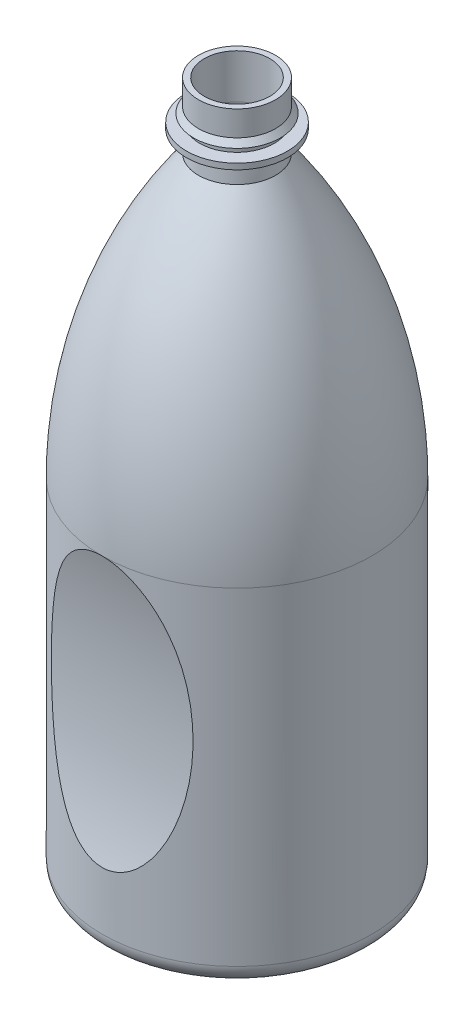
ISO-10303-21;
HEADER;
FILE_DESCRIPTION(('STEP AP214'),'2;1');
FILE_NAME('part.step','',(''),(''),'','','');
FILE_SCHEMA(('AUTOMOTIVE_DESIGN { 1 0 10303 214 1 1 1 1 }'));
ENDSEC;
DATA;
#1=APPLICATION_CONTEXT('core data for automotive mechanical design processes');
#2=APPLICATION_PROTOCOL_DEFINITION('international standard','automotive_design',2000,#1);
#3=PRODUCT_CONTEXT('',#1,'mechanical');
#4=PRODUCT('Part','Part','',(#3));
#5=PRODUCT_RELATED_PRODUCT_CATEGORY('part','',(#4));
#6=PRODUCT_DEFINITION_FORMATION('','',#4);
#7=PRODUCT_DEFINITION_CONTEXT('part definition',#1,'design');
#8=PRODUCT_DEFINITION('design','',#6,#7);
#9=PRODUCT_DEFINITION_SHAPE('','',#8);
#10=(LENGTH_UNIT() NAMED_UNIT(*) SI_UNIT(.MILLI.,.METRE.));
#11=(NAMED_UNIT(*) PLANE_ANGLE_UNIT() SI_UNIT($,.RADIAN.));
#12=(NAMED_UNIT(*) SI_UNIT($,.STERADIAN.) SOLID_ANGLE_UNIT());
#13=UNCERTAINTY_MEASURE_WITH_UNIT(LENGTH_MEASURE(1.E-05),#10,'distance_accuracy_value','');
#14=(GEOMETRIC_REPRESENTATION_CONTEXT(3) GLOBAL_UNCERTAINTY_ASSIGNED_CONTEXT((#13)) GLOBAL_UNIT_ASSIGNED_CONTEXT((#10,
#11,#12)) REPRESENTATION_CONTEXT('',''));
#15=CARTESIAN_POINT('',(0.,0.,0.));
#16=DIRECTION('',(0.,0.,1.));
#17=DIRECTION('',(1.,0.,0.));
#18=AXIS2_PLACEMENT_3D('',#15,#16,#17);
#19=CARTESIAN_POINT('',(0.,53.,0.));
#20=DIRECTION('',(0.,1.,0.));
#21=DIRECTION('',(0.,0.,1.));
#22=AXIS2_PLACEMENT_3D('',#19,#20,#21);
#23=CYLINDRICAL_SURFACE('',#22,34.5);
#24=CARTESIAN_POINT('',(0.,-105.,0.));
#25=DIRECTION('',(0.,1.,0.));
#26=DIRECTION('',(0.,0.,1.));
#27=AXIS2_PLACEMENT_3D('',#24,#25,#26);
#28=CIRCLE('',#27,34.5);
#29=CARTESIAN_POINT('',(0.,-105.,34.5));
#30=VERTEX_POINT('',#29);
#31=EDGE_CURVE('E97',#30,#30,#28,.T.);
#32=ORIENTED_EDGE('',*,*,#31,.F.);
#33=EDGE_LOOP('',(#32));
#34=FACE_BOUND('',#33,.T.);
#35=CARTESIAN_POINT('',(0.,-20.,0.));
#36=DIRECTION('',(0.,1.,0.));
#37=DIRECTION('',(0.,0.,1.));
#38=AXIS2_PLACEMENT_3D('',#35,#36,#37);
#39=CIRCLE('',#38,34.5);
#40=CARTESIAN_POINT('',(1.24931161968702,-20.,34.4773725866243));
#41=VERTEX_POINT('',#40);
#42=CARTESIAN_POINT('',(1.24931161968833,-20.,-34.4773725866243));
#43=VERTEX_POINT('',#42);
#44=EDGE_CURVE('E78',#41,#43,#39,.T.);
#45=ORIENTED_EDGE('',*,*,#44,.T.);
#46=CARTESIAN_POINT('',(-2.06285140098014,-89.8709291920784,-34.4382729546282));
#47=CARTESIAN_POINT('',(-2.41452931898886,-89.8012444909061,-34.4172055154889));
#48=CARTESIAN_POINT('',(-2.76250880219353,-89.7141474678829,-34.3909401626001));
#49=CARTESIAN_POINT('',(-3.44801356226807,-89.507565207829,-34.3289944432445));
#50=CARTESIAN_POINT('',(-3.78553094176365,-89.3880561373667,-34.2933071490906));
#51=CARTESIAN_POINT('',(-4.44866547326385,-89.1192661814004,-34.2136122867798));
#52=CARTESIAN_POINT('',(-4.77424185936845,-88.9698928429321,-34.1695789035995));
#53=CARTESIAN_POINT('',(-5.41094775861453,-88.6448034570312,-34.0745557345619));
#54=CARTESIAN_POINT('',(-5.72207204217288,-88.4690779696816,-34.0235634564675));
#55=CARTESIAN_POINT('',(-6.41204435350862,-88.0431982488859,-33.9011767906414));
#56=CARTESIAN_POINT('',(-6.78613039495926,-87.7858348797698,-33.8280176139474));
#57=CARTESIAN_POINT('',(-7.50898286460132,-87.2395465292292,-33.6749433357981));
#58=CARTESIAN_POINT('',(-7.85774034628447,-86.95061048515,-33.5950258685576));
#59=CARTESIAN_POINT('',(-8.53056055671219,-86.3462452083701,-33.4305184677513));
#60=CARTESIAN_POINT('',(-8.85460855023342,-86.0308003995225,-33.3459257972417));
#61=CARTESIAN_POINT('',(-9.47889136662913,-85.3778455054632,-33.1738666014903));
#62=CARTESIAN_POINT('',(-9.77911795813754,-85.0403278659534,-33.0863990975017));
#63=CARTESIAN_POINT('',(-10.5364155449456,-84.1316031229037,-32.8553529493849));
#64=CARTESIAN_POINT('',(-10.9751731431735,-83.5453789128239,-32.7106443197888));
#65=CARTESIAN_POINT('',(-11.799432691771,-82.3363103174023,-32.4224296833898));
#66=CARTESIAN_POINT('',(-12.1849007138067,-81.7134429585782,-32.2789244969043));
#67=CARTESIAN_POINT('',(-12.9087120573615,-80.438598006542,-31.9963475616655));
#68=CARTESIAN_POINT('',(-13.2469700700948,-79.7865704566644,-31.8572841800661));
#69=CARTESIAN_POINT('',(-13.8805395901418,-78.4607653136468,-31.5863775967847));
#70=CARTESIAN_POINT('',(-14.1758559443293,-77.7869901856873,-31.4545335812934));
#71=CARTESIAN_POINT('',(-14.6947326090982,-76.5042364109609,-31.2151599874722));
#72=CARTESIAN_POINT('',(-14.9226511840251,-75.8971953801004,-31.1066120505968));
#73=CARTESIAN_POINT('',(-15.3511382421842,-74.6721275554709,-30.8974013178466));
#74=CARTESIAN_POINT('',(-15.55170265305,-74.0540991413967,-30.7967396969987));
#75=CARTESIAN_POINT('',(-15.9276784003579,-72.8087397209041,-30.6039815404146));
#76=CARTESIAN_POINT('',(-16.1030745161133,-72.1814033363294,-30.5118901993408));
#77=CARTESIAN_POINT('',(-16.4303654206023,-70.9194127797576,-30.3369001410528));
#78=CARTESIAN_POINT('',(-16.5822611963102,-70.284758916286,-30.2540010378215));
#79=CARTESIAN_POINT('',(-16.8644171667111,-69.0078754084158,-30.0976327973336));
#80=CARTESIAN_POINT('',(-16.9946235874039,-68.3656310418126,-30.0241871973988));
#81=CARTESIAN_POINT('',(-17.2342156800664,-67.0762243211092,-29.8873022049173));
#82=CARTESIAN_POINT('',(-17.3436013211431,-66.4290619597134,-29.8238628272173));
#83=CARTESIAN_POINT('',(-17.5425681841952,-65.1309355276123,-29.7072649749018));
#84=CARTESIAN_POINT('',(-17.6321538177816,-64.4799723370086,-29.6541042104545));
#85=CARTESIAN_POINT('',(-17.792383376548,-63.1749456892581,-29.5582438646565));
#86=CARTESIAN_POINT('',(-17.8630266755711,-62.5208821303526,-29.5155446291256));
#87=CARTESIAN_POINT('',(-18.006307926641,-60.9942810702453,-29.4284241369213));
#88=CARTESIAN_POINT('',(-18.0719180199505,-60.1208414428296,-29.3880804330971));
#89=CARTESIAN_POINT('',(-18.1718415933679,-58.3714791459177,-29.3263972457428));
#90=CARTESIAN_POINT('',(-18.2061532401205,-57.4955563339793,-29.3050588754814));
#91=CARTESIAN_POINT('',(-18.2440215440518,-55.7423550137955,-29.2814989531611));
#92=CARTESIAN_POINT('',(-18.2475629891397,-54.8650760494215,-29.2792868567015));
#93=CARTESIAN_POINT('',(-18.223907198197,-53.1111157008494,-29.2940164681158));
#94=CARTESIAN_POINT('',(-18.196710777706,-52.2344343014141,-29.310957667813));
#95=CARTESIAN_POINT('',(-18.1112528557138,-50.485207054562,-29.3638391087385));
#96=CARTESIAN_POINT('',(-18.0530640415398,-49.6126563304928,-29.3997348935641));
#97=CARTESIAN_POINT('',(-17.9047441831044,-47.8711952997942,-29.4902984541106));
#98=CARTESIAN_POINT('',(-17.8146116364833,-47.0022851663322,-29.5449671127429));
#99=CARTESIAN_POINT('',(-17.6010311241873,-45.270515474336,-29.6727012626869));
#100=CARTESIAN_POINT('',(-17.4776061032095,-44.4076521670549,-29.7457540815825));
#101=CARTESIAN_POINT('',(-17.1954089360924,-42.6895419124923,-29.9097739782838));
#102=CARTESIAN_POINT('',(-17.0366421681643,-41.8342938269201,-30.0007383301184));
#103=CARTESIAN_POINT('',(-16.6814314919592,-40.1354614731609,-30.1996894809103));
#104=CARTESIAN_POINT('',(-16.4850653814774,-39.2918569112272,-30.3076410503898));
#105=CARTESIAN_POINT('',(-16.051029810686,-37.6175674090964,-30.5397295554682));
#106=CARTESIAN_POINT('',(-15.8133624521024,-36.7868818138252,-30.6638656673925));
#107=CARTESIAN_POINT('',(-15.2924289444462,-35.1423341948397,-30.926959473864));
#108=CARTESIAN_POINT('',(-15.0091677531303,-34.3284703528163,-31.0659155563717));
#109=CARTESIAN_POINT('',(-14.3916907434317,-32.7226449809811,-31.3567527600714));
#110=CARTESIAN_POINT('',(-14.0574855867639,-31.9306789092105,-31.5086311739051));
#111=CARTESIAN_POINT('',(-13.4158936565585,-30.5563535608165,-31.7860924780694));
#112=CARTESIAN_POINT('',(-13.1203269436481,-29.9680584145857,-31.9095827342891));
#113=CARTESIAN_POINT('',(-12.4916437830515,-28.8125644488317,-32.1609015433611));
#114=CARTESIAN_POINT('',(-12.1585219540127,-28.2453686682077,-32.2887307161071));
#115=CARTESIAN_POINT('',(-11.4514675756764,-27.138824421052,-32.5462011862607));
#116=CARTESIAN_POINT('',(-11.077612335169,-26.5994259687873,-32.675838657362));
#117=CARTESIAN_POINT('',(-10.2844523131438,-25.554972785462,-32.9340858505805));
#118=CARTESIAN_POINT('',(-9.86517601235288,-25.0498968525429,-33.0626961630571));
#119=CARTESIAN_POINT('',(-9.15733488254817,-24.2801309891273,-33.2636153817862));
#120=CARTESIAN_POINT('',(-8.88481866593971,-24.0011036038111,-33.3375817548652));
#121=CARTESIAN_POINT('',(-8.32161556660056,-23.4613335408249,-33.4826144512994));
#122=CARTESIAN_POINT('',(-8.03092741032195,-23.2005921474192,-33.5536805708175));
#123=CARTESIAN_POINT('',(-7.13092752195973,-22.450692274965,-33.7605963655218));
#124=CARTESIAN_POINT('',(-6.49271657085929,-21.9927822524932,-33.8904473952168));
#125=CARTESIAN_POINT('',(-5.54446326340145,-21.43045057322,-34.0526982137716));
#126=CARTESIAN_POINT('',(-5.26453627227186,-21.2775636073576,-34.0971859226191));
#127=CARTESIAN_POINT('',(-4.69329602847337,-20.9930818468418,-34.1804940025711));
#128=CARTESIAN_POINT('',(-4.40198842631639,-20.8614766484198,-34.2193171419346));
#129=CARTESIAN_POINT('',(-3.80915164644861,-20.6218682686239,-34.2903696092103));
#130=CARTESIAN_POINT('',(-3.50762655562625,-20.5138557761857,-34.3226015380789));
#131=CARTESIAN_POINT('',(-2.89583981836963,-20.3235205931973,-34.3796227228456));
#132=CARTESIAN_POINT('',(-2.58557817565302,-20.2411978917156,-34.4044119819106));
#133=CARTESIAN_POINT('',(-1.95599443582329,-20.1035694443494,-34.4459629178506));
#134=CARTESIAN_POINT('',(-1.63662038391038,-20.0484805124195,-34.4626601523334));
#135=CARTESIAN_POINT('',(-0.993817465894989,-19.9676726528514,-34.4871824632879));
#136=CARTESIAN_POINT('',(-0.67038860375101,-19.941953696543,-34.4950075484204));
#137=CARTESIAN_POINT('',(-0.0225316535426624,-19.9205674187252,-34.5015130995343));
#138=CARTESIAN_POINT('',(0.301896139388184,-19.9248919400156,-34.5001960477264));
#139=CARTESIAN_POINT('',(0.948780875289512,-19.9634610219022,-34.4884682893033));
#140=CARTESIAN_POINT('',(1.27123795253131,-19.9977035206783,-34.4780582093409));
#141=CARTESIAN_POINT('',(1.8729563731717,-20.0893586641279,-34.4502777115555));
#142=CARTESIAN_POINT('',(2.1527686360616,-20.1435077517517,-34.4338894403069));
#143=CARTESIAN_POINT('',(2.70699572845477,-20.27326706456,-34.3947578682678));
#144=CARTESIAN_POINT('',(2.98140887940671,-20.348883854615,-34.372012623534));
#145=CARTESIAN_POINT('',(3.52328491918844,-20.5202453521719,-34.3207013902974));
#146=CARTESIAN_POINT('',(3.79074796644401,-20.6159896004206,-34.2921355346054));
#147=CARTESIAN_POINT('',(4.31764944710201,-20.8261061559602,-34.2297871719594));
#148=CARTESIAN_POINT('',(4.57708605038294,-20.9404826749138,-34.1960034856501));
#149=CARTESIAN_POINT('',(5.19062863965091,-21.2361787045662,-34.1092133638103));
#150=CARTESIAN_POINT('',(5.54042317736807,-21.4258275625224,-34.0539700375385));
#151=CARTESIAN_POINT('',(6.22118698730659,-21.8344348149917,-33.9362095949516));
#152=CARTESIAN_POINT('',(6.55214808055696,-22.0534058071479,-33.8736893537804));
#153=CARTESIAN_POINT('',(7.19530757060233,-22.5169393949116,-33.7429318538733));
#154=CARTESIAN_POINT('',(7.50747011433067,-22.7615485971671,-33.6746842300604));
#155=CARTESIAN_POINT('',(8.11245062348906,-23.2722860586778,-33.5340806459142));
#156=CARTESIAN_POINT('',(8.40527180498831,-23.5384107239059,-33.4617253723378));
#157=CARTESIAN_POINT('',(9.1286348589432,-24.2409800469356,-33.2734856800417));
#158=CARTESIAN_POINT('',(9.54607250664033,-24.690417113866,-33.1556009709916));
#159=CARTESIAN_POINT('',(10.3391146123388,-25.6240938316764,-32.9169298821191));
#160=CARTESIAN_POINT('',(10.7146950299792,-26.1083532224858,-32.7961418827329));
#161=CARTESIAN_POINT('',(11.4279550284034,-27.1050859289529,-32.5544744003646));
#162=CARTESIAN_POINT('',(11.7655713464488,-27.6176042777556,-32.4335950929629));
#163=CARTESIAN_POINT('',(12.4055945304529,-28.664508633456,-32.1942219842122));
#164=CARTESIAN_POINT('',(12.70800443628,-29.1988927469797,-32.0757279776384));
#165=CARTESIAN_POINT('',(13.2454057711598,-30.2181767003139,-31.8572211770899));
#166=CARTESIAN_POINT('',(13.4841104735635,-30.7010318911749,-31.7567339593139));
#167=CARTESIAN_POINT('',(13.9388701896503,-31.6781570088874,-31.5597736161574));
#168=CARTESIAN_POINT('',(14.1549217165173,-32.1724286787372,-31.4633011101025));
#169=CARTESIAN_POINT('',(14.5661303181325,-33.1707443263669,-31.2750537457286));
#170=CARTESIAN_POINT('',(14.7612764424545,-33.6747932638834,-31.1832813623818));
#171=CARTESIAN_POINT('',(15.1320628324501,-34.6909859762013,-31.0050476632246));
#172=CARTESIAN_POINT('',(15.3077008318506,-35.2031306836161,-30.9185869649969));
#173=CARTESIAN_POINT('',(15.6410684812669,-36.2351950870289,-30.7512896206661));
#174=CARTESIAN_POINT('',(15.7987638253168,-36.7551275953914,-30.6704638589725));
#175=CARTESIAN_POINT('',(16.0970263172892,-37.8008322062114,-30.5149802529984));
#176=CARTESIAN_POINT('',(16.2375919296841,-38.3266048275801,-30.4403229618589));
#177=CARTESIAN_POINT('',(16.5025440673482,-39.3829362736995,-30.2975029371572));
#178=CARTESIAN_POINT('',(16.6269345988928,-39.9134938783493,-30.2293385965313));
#179=CARTESIAN_POINT('',(16.8604380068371,-40.9787826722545,-30.0997246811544));
#180=CARTESIAN_POINT('',(16.9695501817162,-41.5135140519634,-30.0382754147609));
#181=CARTESIAN_POINT('',(17.2300702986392,-42.8858508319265,-29.8899346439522));
#182=CARTESIAN_POINT('',(17.371109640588,-43.7259784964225,-29.8079773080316));
#183=CARTESIAN_POINT('',(17.6201791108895,-45.4126484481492,-29.6614241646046));
#184=CARTESIAN_POINT('',(17.7282058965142,-46.2591913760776,-29.5968301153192));
#185=CARTESIAN_POINT('',(17.9129634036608,-47.9572983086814,-29.4853757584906));
#186=CARTESIAN_POINT('',(17.989677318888,-48.80886476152,-29.4385249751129));
#187=CARTESIAN_POINT('',(18.1128942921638,-50.5149380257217,-29.3628723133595));
#188=CARTESIAN_POINT('',(18.1593983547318,-51.3694447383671,-29.334069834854));
#189=CARTESIAN_POINT('',(18.2229170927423,-53.0804278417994,-29.2946528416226));
#190=CARTESIAN_POINT('',(18.2399158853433,-53.9369050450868,-29.2840481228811));
#191=CARTESIAN_POINT('',(18.2446297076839,-55.649992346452,-29.2811115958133));
#192=CARTESIAN_POINT('',(18.2323440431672,-56.5066024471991,-29.2887802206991));
#193=CARTESIAN_POINT('',(18.1783156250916,-58.2181532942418,-29.3223438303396));
#194=CARTESIAN_POINT('',(18.1365860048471,-59.0730946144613,-29.3482306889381));
#195=CARTESIAN_POINT('',(18.0230604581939,-60.7802128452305,-29.4180859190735));
#196=CARTESIAN_POINT('',(17.951266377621,-61.6323899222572,-29.4620531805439));
#197=CARTESIAN_POINT('',(17.8004531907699,-63.0995292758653,-29.5533294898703));
#198=CARTESIAN_POINT('',(17.7288013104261,-63.71552241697,-29.5964234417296));
#199=CARTESIAN_POINT('',(17.568478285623,-64.9445672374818,-29.691872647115));
#200=CARTESIAN_POINT('',(17.4798075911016,-65.5576189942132,-29.7442276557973));
#201=CARTESIAN_POINT('',(17.2846965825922,-66.7801535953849,-29.8580311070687));
#202=CARTESIAN_POINT('',(17.1782532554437,-67.3896358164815,-29.919481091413));
#203=CARTESIAN_POINT('',(16.9467052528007,-68.6040925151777,-30.051238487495));
#204=CARTESIAN_POINT('',(16.8216005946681,-69.2090669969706,-30.1215458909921));
#205=CARTESIAN_POINT('',(16.5520302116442,-70.4118236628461,-30.2705129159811));
#206=CARTESIAN_POINT('',(16.4076207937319,-71.0096214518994,-30.3491481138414));
#207=CARTESIAN_POINT('',(16.0978945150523,-72.1986309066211,-30.5145641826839));
#208=CARTESIAN_POINT('',(15.9325784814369,-72.7898428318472,-30.6013447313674));
#209=CARTESIAN_POINT('',(15.5796139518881,-73.9640759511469,-30.7825434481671));
#210=CARTESIAN_POINT('',(15.3919765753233,-74.5471010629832,-30.8769578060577));
#211=CARTESIAN_POINT('',(14.9925691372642,-75.703556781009,-31.0728556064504));
#212=CARTESIAN_POINT('',(14.7808024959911,-76.2769887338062,-31.174338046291));
#213=CARTESIAN_POINT('',(14.3246621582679,-77.4285123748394,-31.3866080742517));
#214=CARTESIAN_POINT('',(14.0795320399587,-78.006272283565,-31.4975782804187));
#215=CARTESIAN_POINT('',(13.5589720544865,-79.1468974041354,-31.7251477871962));
#216=CARTESIAN_POINT('',(13.2835429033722,-79.7097629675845,-31.8417469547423));
#217=CARTESIAN_POINT('',(12.6993756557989,-80.8171965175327,-32.0792037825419));
#218=CARTESIAN_POINT('',(12.3906332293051,-81.3617621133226,-32.2000619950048));
#219=CARTESIAN_POINT('',(11.7365551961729,-82.4279349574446,-32.4441858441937));
#220=CARTESIAN_POINT('',(11.3912271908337,-82.9495469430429,-32.5674509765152));
#221=CARTESIAN_POINT('',(10.7405451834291,-83.8525518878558,-32.7869053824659));
#222=CARTESIAN_POINT('',(10.4430473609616,-84.2395975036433,-32.8831006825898));
#223=CARTESIAN_POINT('',(9.82171208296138,-84.9925016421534,-33.0740029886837));
#224=CARTESIAN_POINT('',(9.49787267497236,-85.3583585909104,-33.1687098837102));
#225=CARTESIAN_POINT('',(8.8227618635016,-86.0637370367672,-33.3546270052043));
#226=CARTESIAN_POINT('',(8.4715393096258,-86.4033033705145,-33.4458430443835));
#227=CARTESIAN_POINT('',(7.7402143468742,-87.0510245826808,-33.6226222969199));
#228=CARTESIAN_POINT('',(7.36012508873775,-87.3591936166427,-33.7081880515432));
#229=CARTESIAN_POINT('',(6.42705375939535,-88.0424146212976,-33.9004986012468));
#230=CARTESIAN_POINT('',(5.86119144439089,-88.4014497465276,-34.0037378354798));
#231=CARTESIAN_POINT('',(4.97394908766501,-88.8720387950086,-34.1408790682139));
#232=CARTESIAN_POINT('',(4.67168017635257,-89.0176138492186,-34.1836518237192));
#233=CARTESIAN_POINT('',(4.05540967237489,-89.2834858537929,-34.2622238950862));
#234=CARTESIAN_POINT('',(3.74141418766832,-89.4037957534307,-34.2980267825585));
#235=CARTESIAN_POINT('',(3.09962219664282,-89.6178407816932,-34.3620069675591));
#236=CARTESIAN_POINT('',(2.77170817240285,-89.7112529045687,-34.390091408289));
#237=CARTESIAN_POINT('',(2.10790654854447,-89.8673150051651,-34.4371514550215));
#238=CARTESIAN_POINT('',(1.7720180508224,-89.9299615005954,-34.4561260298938));
#239=CARTESIAN_POINT('',(1.09606418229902,-90.0226507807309,-34.4842402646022));
#240=CARTESIAN_POINT('',(0.756009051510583,-90.0527616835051,-34.4934004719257));
#241=CARTESIAN_POINT('',(0.0746283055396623,-90.0797184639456,-34.501599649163));
#242=CARTESIAN_POINT('',(-0.266696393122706,-90.0765849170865,-34.5006448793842));
#243=CARTESIAN_POINT('',(-0.851559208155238,-90.0427548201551,-34.4903585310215));
#244=CARTESIAN_POINT('',(-1.09563680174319,-90.0200469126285,-34.4834550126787));
#245=CARTESIAN_POINT('',(-1.58133301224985,-89.9578981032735,-34.4645966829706));
#246=CARTESIAN_POINT('',(-1.82295271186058,-89.9184649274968,-34.452644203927));
#247=CARTESIAN_POINT('',(-2.06285140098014,-89.8709291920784,-34.4382729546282));
#248=B_SPLINE_CURVE_WITH_KNOTS('',3,(#46,#47,#48,#49,#50,#51,#52,#53,#54,#55,#56,#57,#58,#59,
#60,#61,#62,#63,#64,#65,#66,#67,#68,#69,#70,#71,#72,#73,#74,#75,#76,#77,#78,#79,#80,#81,#82,#83,
#84,#85,#86,#87,#88,#89,#90,#91,#92,#93,#94,#95,#96,#97,#98,#99,#100,#101,#102,#103,#104,#105,
#106,#107,#108,#109,#110,#111,#112,#113,#114,#115,#116,#117,#118,#119,#120,#121,#122,#123,#124,
#125,#126,#127,#128,#129,#130,#131,#132,#133,#134,#135,#136,#137,#138,#139,#140,#141,#142,#143,
#144,#145,#146,#147,#148,#149,#150,#151,#152,#153,#154,#155,#156,#157,#158,#159,#160,#161,#162,
#163,#164,#165,#166,#167,#168,#169,#170,#171,#172,#173,#174,#175,#176,#177,#178,#179,#180,#181,
#182,#183,#184,#185,#186,#187,#188,#189,#190,#191,#192,#193,#194,#195,#196,#197,#198,#199,#200,
#201,#202,#203,#204,#205,#206,#207,#208,#209,#210,#211,#212,#213,#214,#215,#216,#217,#218,#219,
#220,#221,#222,#223,#224,#225,#226,#227,#228,#229,#230,#231,#232,#233,#234,#235,#236,#237,#238,
#239,#240,#241,#242,#243,#244,#245,#246,#247),.UNSPECIFIED.,.T.,.F.,(4,2,2,2,2,2,2,2,2,2,2,2,2,
2,2,2,2,2,2,2,2,2,2,2,2,2,2,2,2,2,2,2,2,2,2,2,2,2,2,2,2,2,2,2,2,2,2,2,2,2,2,2,2,2,2,2,2,2,2,2,2,
2,2,2,2,2,2,2,2,2,2,2,2,2,2,2,2,2,2,2,2,2,2,2,2,2,2,2,2,2,2,2,2,2,2,2,2,2,2,2,4),(0.,
1.0770807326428,2.15495562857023,3.23622054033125,4.3178737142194,5.69548180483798,
7.07357414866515,8.45248197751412,9.83186422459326,12.0674218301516,14.3043962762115,
16.5453620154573,18.7860746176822,20.7576514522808,22.7295214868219,24.702579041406,
26.6755537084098,28.6533493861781,30.6311479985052,32.6085054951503,34.5859283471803,
37.2155922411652,39.8454101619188,42.4765281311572,45.1075762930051,47.7324807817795,
50.3575087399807,52.9807321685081,55.6035566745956,58.2210117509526,60.8383336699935,
63.4553711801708,66.0718617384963,68.0802328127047,70.0888920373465,72.093803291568,
74.0974645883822,75.287585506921,76.4777899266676,78.8538151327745,79.8192347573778,
80.7841809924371,81.7487457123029,82.7133100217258,83.6854345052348,84.6575580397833,
85.6294176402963,86.6012102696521,87.4566960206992,88.3124436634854,89.1681717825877,
90.0240936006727,91.2273921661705,92.4312093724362,93.637254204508,94.8430979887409,
96.7139318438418,98.5858347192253,100.460812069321,102.335627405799,103.978780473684,
105.622186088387,107.266448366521,108.910901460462,110.558447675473,112.206141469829,
113.853426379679,115.500786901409,118.067292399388,120.634057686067,123.202198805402,
125.770254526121,128.339692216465,130.909190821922,133.477544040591,136.04573959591,
137.91038433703,139.77497978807,141.639891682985,143.504801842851,145.36438662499,
147.223897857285,149.082486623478,150.940812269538,152.852021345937,154.763185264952,
156.674597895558,158.585614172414,160.077291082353,161.569078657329,163.058263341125,
164.546773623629,166.572642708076,167.586291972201,168.599420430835,169.624251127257,
170.649197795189,171.671994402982,172.694158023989,173.429232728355,174.163968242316),.UNSPECIFIED.);
#249=CARTESIAN_POINT('',(-1.2493116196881,-20.,-34.4773725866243));
#250=VERTEX_POINT('',#249);
#251=EDGE_CURVE('E85',#43,#250,#248,.T.);
#252=ORIENTED_EDGE('',*,*,#251,.T.);
#253=CARTESIAN_POINT('',(0.,-20.,0.));
#254=DIRECTION('',(0.,1.,0.));
#255=DIRECTION('',(0.,0.,1.));
#256=AXIS2_PLACEMENT_3D('',#253,#254,#255);
#257=CIRCLE('',#256,34.5);
#258=CARTESIAN_POINT('',(-1.24931161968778,-20.,34.4773725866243));
#259=VERTEX_POINT('',#258);
#260=EDGE_CURVE('E80',#250,#259,#257,.T.);
#261=ORIENTED_EDGE('',*,*,#260,.T.);
#262=CARTESIAN_POINT('',(1.70917348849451,-89.9349153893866,34.4576366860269));
#263=CARTESIAN_POINT('',(1.39397709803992,-89.9865270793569,34.4732711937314));
#264=CARTESIAN_POINT('',(1.07626476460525,-90.0240845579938,34.4846835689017));
#265=CARTESIAN_POINT('',(0.438418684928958,-90.0701581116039,34.4986893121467));
#266=CARTESIAN_POINT('',(0.118284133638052,-90.0786640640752,34.501279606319));
#267=CARTESIAN_POINT('',(-0.521650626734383,-90.0663764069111,34.4975413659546));
#268=CARTESIAN_POINT('',(-0.841450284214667,-90.0455566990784,34.4912048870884));
#269=CARTESIAN_POINT('',(-1.47752450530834,-89.9751137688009,34.4698156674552));
#270=CARTESIAN_POINT('',(-1.79379930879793,-89.9254925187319,34.4547635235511));
#271=CARTESIAN_POINT('',(-2.41851761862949,-89.7990215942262,34.4165395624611));
#272=CARTESIAN_POINT('',(-2.72699446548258,-89.7223221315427,34.3934125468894));
#273=CARTESIAN_POINT('',(-3.33573945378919,-89.5433825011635,34.3397181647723));
#274=CARTESIAN_POINT('',(-3.63600751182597,-89.4411420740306,34.3091507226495));
#275=CARTESIAN_POINT('',(-4.22676973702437,-89.213134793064,34.2413907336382));
#276=CARTESIAN_POINT('',(-4.51726127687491,-89.0873616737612,34.2041964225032));
#277=CARTESIAN_POINT('',(-5.08729043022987,-88.8145155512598,34.1240743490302));
#278=CARTESIAN_POINT('',(-5.36682219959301,-88.6674313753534,34.0811435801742));
#279=CARTESIAN_POINT('',(-6.38822092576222,-88.0827015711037,33.9118653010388));
#280=CARTESIAN_POINT('',(-7.09283359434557,-87.5828020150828,33.7697567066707));
#281=CARTESIAN_POINT('',(-8.08052283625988,-86.7571601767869,33.5420666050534));
#282=CARTESIAN_POINT('',(-8.39861922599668,-86.4688475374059,33.4636261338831));
#283=CARTESIAN_POINT('',(-9.01294927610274,-85.8705387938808,33.3034112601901));
#284=CARTESIAN_POINT('',(-9.30918575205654,-85.5605454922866,33.2216372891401));
#285=CARTESIAN_POINT('',(-10.0540854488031,-84.7287096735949,33.0059760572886));
#286=CARTESIAN_POINT('',(-10.4861851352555,-84.1924426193,32.8705715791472));
#287=CARTESIAN_POINT('',(-11.3012677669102,-83.0838342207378,32.5993214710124));
#288=CARTESIAN_POINT('',(-11.6842200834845,-82.5114707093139,32.4634756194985));
#289=CARTESIAN_POINT('',(-12.4062874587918,-81.3379311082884,32.1944507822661));
#290=CARTESIAN_POINT('',(-12.7453272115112,-80.7367078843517,32.0612767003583));
#291=CARTESIAN_POINT('',(-13.3832459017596,-79.5124277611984,31.8002740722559));
#292=CARTESIAN_POINT('',(-13.6821291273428,-78.8893732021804,31.6724449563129));
#293=CARTESIAN_POINT('',(-14.2104216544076,-77.700710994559,31.4386235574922));
#294=CARTESIAN_POINT('',(-14.443866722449,-77.1370382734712,31.3318379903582));
#295=CARTESIAN_POINT('',(-14.8849655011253,-75.9984593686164,31.1247037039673));
#296=CARTESIAN_POINT('',(-15.0926152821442,-75.4235514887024,31.024355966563));
#297=CARTESIAN_POINT('',(-15.4841986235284,-74.2641702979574,30.8307848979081));
#298=CARTESIAN_POINT('',(-15.668117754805,-73.6796914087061,30.7375659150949));
#299=CARTESIAN_POINT('',(-16.0138061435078,-72.5030979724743,30.5588915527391));
#300=CARTESIAN_POINT('',(-16.1755763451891,-71.9109837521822,30.4734358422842));
#301=CARTESIAN_POINT('',(-16.4787908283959,-70.7190271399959,30.3105448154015));
#302=CARTESIAN_POINT('',(-16.6201876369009,-70.1191701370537,30.2331283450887));
#303=CARTESIAN_POINT('',(-16.8834646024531,-68.9141626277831,30.0868955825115));
#304=CARTESIAN_POINT('',(-17.0053447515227,-68.3090121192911,30.0180792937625));
#305=CARTESIAN_POINT('',(-17.2306161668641,-67.0944823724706,29.8893407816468));
#306=CARTESIAN_POINT('',(-17.3340113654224,-66.4851040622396,29.8294166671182));
#307=CARTESIAN_POINT('',(-17.5232152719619,-65.2627941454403,29.7186626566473));
#308=CARTESIAN_POINT('',(-17.6090233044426,-64.6498624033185,29.6678331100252));
#309=CARTESIAN_POINT('',(-17.7959450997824,-63.1656696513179,29.5562303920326));
#310=CARTESIAN_POINT('',(-17.8885848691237,-62.2929774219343,29.5001121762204));
#311=CARTESIAN_POINT('',(-18.041556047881,-60.5437295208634,29.4068057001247));
#312=CARTESIAN_POINT('',(-18.1018850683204,-59.6671735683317,29.3696188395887));
#313=CARTESIAN_POINT('',(-18.1912096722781,-57.9114195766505,29.3143762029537));
#314=CARTESIAN_POINT('',(-18.2201892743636,-57.0322204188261,29.2963301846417));
#315=CARTESIAN_POINT('',(-18.2472183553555,-55.2731920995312,29.2795025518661));
#316=CARTESIAN_POINT('',(-18.2452687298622,-54.3933629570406,29.2807203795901));
#317=CARTESIAN_POINT('',(-18.2104341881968,-52.6357359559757,29.3023977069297));
#318=CARTESIAN_POINT('',(-18.1775909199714,-51.757936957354,29.3228313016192));
#319=CARTESIAN_POINT('',(-18.0805084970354,-50.0046877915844,29.3827921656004));
#320=CARTESIAN_POINT('',(-18.0162681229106,-49.1292377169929,29.4223201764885));
#321=CARTESIAN_POINT('',(-17.8554142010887,-47.3828877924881,29.5202146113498));
#322=CARTESIAN_POINT('',(-17.7588201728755,-46.5119855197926,29.5785696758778));
#323=CARTESIAN_POINT('',(-17.5316958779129,-44.7761543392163,29.7137525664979));
#324=CARTESIAN_POINT('',(-17.4011697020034,-43.9112247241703,29.7905781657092));
#325=CARTESIAN_POINT('',(-17.0855156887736,-42.0821588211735,29.9728641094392));
#326=CARTESIAN_POINT('',(-16.8956143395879,-41.1190715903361,30.0806981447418));
#327=CARTESIAN_POINT('',(-16.4660513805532,-39.2067098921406,30.3179712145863));
#328=CARTESIAN_POINT('',(-16.2263900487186,-38.2574353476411,30.4474101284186));
#329=CARTESIAN_POINT('',(-15.6921070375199,-36.3782624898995,30.7261915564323));
#330=CARTESIAN_POINT('',(-15.3975416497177,-35.4483454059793,30.8755136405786));
#331=CARTESIAN_POINT('',(-14.9091965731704,-34.0724652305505,31.1126707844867));
#332=CARTESIAN_POINT('',(-14.7386771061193,-33.6170313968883,31.1939135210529));
#333=CARTESIAN_POINT('',(-14.3810499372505,-32.7134806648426,31.3603948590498));
#334=CARTESIAN_POINT('',(-14.1939434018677,-32.2653632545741,31.4456331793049));
#335=CARTESIAN_POINT('',(-13.7341223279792,-31.22397469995,31.6497606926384));
#336=CARTESIAN_POINT('',(-13.4541908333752,-30.6341413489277,31.7700865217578));
#337=CARTESIAN_POINT('',(-12.8588575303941,-29.4735470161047,32.0156758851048));
#338=CARTESIAN_POINT('',(-12.5434527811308,-28.9027876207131,32.1409398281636));
#339=CARTESIAN_POINT('',(-11.8738995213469,-27.7859788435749,32.3942668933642));
#340=CARTESIAN_POINT('',(-11.5198000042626,-27.2398994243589,32.5223263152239));
#341=CARTESIAN_POINT('',(-10.768552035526,-26.1782943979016,32.7787407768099));
#342=CARTESIAN_POINT('',(-10.3714242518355,-25.662754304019,32.9070956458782));
#343=CARTESIAN_POINT('',(-9.68156772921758,-24.8495531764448,33.114891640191));
#344=CARTESIAN_POINT('',(-9.40276012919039,-24.5403009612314,33.1952980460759));
#345=CARTESIAN_POINT('',(-8.82473108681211,-23.9406258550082,33.3536205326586));
#346=CARTESIAN_POINT('',(-8.52550682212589,-23.6502055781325,33.4315362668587));
#347=CARTESIAN_POINT('',(-7.90624211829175,-23.0920346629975,33.5833697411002));
#348=CARTESIAN_POINT('',(-7.58622926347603,-22.8242550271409,33.6572925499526));
#349=CARTESIAN_POINT('',(-6.92476691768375,-22.3150328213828,33.7995898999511));
#350=CARTESIAN_POINT('',(-6.58331603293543,-22.0735919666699,33.8679640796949));
#351=CARTESIAN_POINT('',(-5.68503839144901,-21.4972865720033,34.0328859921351));
#352=CARTESIAN_POINT('',(-5.11288813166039,-21.18390747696,34.1242917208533));
#353=CARTESIAN_POINT('',(-4.2211178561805,-20.7843415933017,34.242114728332));
#354=CARTESIAN_POINT('',(-3.91821765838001,-20.6628892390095,34.2781791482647));
#355=CARTESIAN_POINT('',(-3.30259478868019,-20.4457472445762,34.3429536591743));
#356=CARTESIAN_POINT('',(-2.98987679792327,-20.3500455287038,34.3716671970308));
#357=CARTESIAN_POINT('',(-2.35364205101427,-20.1857697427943,34.4211145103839));
#358=CARTESIAN_POINT('',(-2.03005213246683,-20.117454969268,34.4417719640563));
#359=CARTESIAN_POINT('',(-1.37747225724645,-20.010944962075,34.4740373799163));
#360=CARTESIAN_POINT('',(-1.04848232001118,-19.9727496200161,34.4856453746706));
#361=CARTESIAN_POINT('',(-0.388314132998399,-19.9275268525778,34.4993936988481));
#362=CARTESIAN_POINT('',(-0.0571369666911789,-19.9204850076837,34.5015384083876));
#363=CARTESIAN_POINT('',(0.604303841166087,-19.937730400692,34.4962920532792));
#364=CARTESIAN_POINT('',(0.934567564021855,-19.9620147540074,34.4889018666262));
#365=CARTESIAN_POINT('',(1.547161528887,-20.0359296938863,34.4664671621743));
#366=CARTESIAN_POINT('',(1.83000475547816,-20.0817436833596,34.4525762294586));
#367=CARTESIAN_POINT('',(2.39088278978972,-20.1954784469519,34.4182021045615));
#368=CARTESIAN_POINT('',(2.668916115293,-20.263405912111,34.397716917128));
#369=CARTESIAN_POINT('',(3.2184889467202,-20.4201219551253,34.3506536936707));
#370=CARTESIAN_POINT('',(3.4900283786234,-20.5089107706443,34.3240755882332));
#371=CARTESIAN_POINT('',(4.02538926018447,-20.7058817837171,34.2654170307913));
#372=CARTESIAN_POINT('',(4.28920899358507,-20.8140682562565,34.2333353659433));
#373=CARTESIAN_POINT('',(4.90189333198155,-21.0905456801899,34.1518424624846));
#374=CARTESIAN_POINT('',(5.24706866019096,-21.2664338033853,34.1003566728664));
#375=CARTESIAN_POINT('',(5.91986413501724,-21.6471334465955,33.9900215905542));
#376=CARTESIAN_POINT('',(6.24747727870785,-21.8519563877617,33.9311693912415));
#377=CARTESIAN_POINT('',(6.88499066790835,-22.2869774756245,33.8075808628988));
#378=CARTESIAN_POINT('',(7.19485953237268,-22.5172185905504,33.7428346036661));
#379=CARTESIAN_POINT('',(7.79618856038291,-22.9992012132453,33.6089914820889));
#380=CARTESIAN_POINT('',(8.08765166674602,-23.2509392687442,33.5398953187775));
#381=CARTESIAN_POINT('',(8.80305176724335,-23.9118108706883,33.3609887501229));
#382=CARTESIAN_POINT('',(9.21496501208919,-24.333425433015,33.2490758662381));
#383=CARTESIAN_POINT('',(9.99933909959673,-25.2109933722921,33.021660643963));
#384=CARTESIAN_POINT('',(10.3717780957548,-25.666965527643,32.9061563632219));
#385=CARTESIAN_POINT('',(11.0807091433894,-26.6069157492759,32.6742583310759));
#386=CARTESIAN_POINT('',(11.4171400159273,-27.0909393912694,32.5578634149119));
#387=CARTESIAN_POINT('',(12.0564074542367,-28.0808447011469,32.3265921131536));
#388=CARTESIAN_POINT('',(12.3592466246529,-28.5867246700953,32.2117156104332));
#389=CARTESIAN_POINT('',(12.8975283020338,-29.5504434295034,31.9996300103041));
#390=CARTESIAN_POINT('',(13.1366385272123,-30.0061646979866,31.9020385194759));
#391=CARTESIAN_POINT('',(13.593323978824,-30.9290089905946,31.7101388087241));
#392=CARTESIAN_POINT('',(13.8108959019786,-31.396133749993,31.6158310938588));
#393=CARTESIAN_POINT('',(14.22614109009,-32.3401773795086,31.4311716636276));
#394=CARTESIAN_POINT('',(14.4238040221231,-32.8171011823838,31.3408220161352));
#395=CARTESIAN_POINT('',(14.8005288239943,-33.7791111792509,31.1646846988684));
#396=CARTESIAN_POINT('',(14.9795885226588,-34.264198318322,31.0788975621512));
#397=CARTESIAN_POINT('',(15.3206273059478,-35.2421469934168,30.9122060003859));
#398=CARTESIAN_POINT('',(15.4825755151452,-35.73502079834,30.8313105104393));
#399=CARTESIAN_POINT('',(15.7901247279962,-36.7267071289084,30.6749348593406));
#400=CARTESIAN_POINT('',(15.9357242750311,-37.225520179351,30.5994551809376));
#401=CARTESIAN_POINT('',(16.3494007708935,-38.7292911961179,30.3816535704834));
#402=CARTESIAN_POINT('',(16.5944712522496,-39.7419179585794,30.2479113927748));
#403=CARTESIAN_POINT('',(16.9858683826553,-41.5775383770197,30.0294766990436));
#404=CARTESIAN_POINT('',(17.1421410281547,-42.3979383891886,29.9403242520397));
#405=CARTESIAN_POINT('',(17.4218105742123,-44.0460381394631,29.7784604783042));
#406=CARTESIAN_POINT('',(17.5452038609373,-44.8737386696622,29.705750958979));
#407=CARTESIAN_POINT('',(17.7610230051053,-46.5349007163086,29.5772174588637));
#408=CARTESIAN_POINT('',(17.853431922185,-47.3683651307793,29.5214027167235));
#409=CARTESIAN_POINT('',(18.0085606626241,-49.03898528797,29.4270280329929));
#410=CARTESIAN_POINT('',(18.0712815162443,-49.8761409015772,29.388467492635));
#411=CARTESIAN_POINT('',(18.1680088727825,-51.5536604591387,29.3287687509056));
#412=CARTESIAN_POINT('',(18.2019831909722,-52.3940269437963,29.3076500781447));
#413=CARTESIAN_POINT('',(18.2415916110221,-54.0756991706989,29.2830134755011));
#414=CARTESIAN_POINT('',(18.2472251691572,-54.9170049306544,29.2794958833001));
#415=CARTESIAN_POINT('',(18.2302349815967,-56.5988820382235,29.2900772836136));
#416=CARTESIAN_POINT('',(18.2076225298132,-57.4394535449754,29.304169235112));
#417=CARTESIAN_POINT('',(18.1338354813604,-59.1188456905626,29.3498879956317));
#418=CARTESIAN_POINT('',(18.082662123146,-59.9576664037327,29.381514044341));
#419=CARTESIAN_POINT('',(17.9645495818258,-61.4598866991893,29.4538393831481));
#420=CARTESIAN_POINT('',(17.9030199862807,-62.1238718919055,29.4913333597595));
#421=CARTESIAN_POINT('',(17.7608932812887,-63.449091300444,29.5771463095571));
#422=CARTESIAN_POINT('',(17.6802966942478,-64.1103255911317,29.6254649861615));
#423=CARTESIAN_POINT('',(17.4992552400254,-65.429367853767,29.7327621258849));
#424=CARTESIAN_POINT('',(17.3988057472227,-66.0871749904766,29.7917430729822));
#425=CARTESIAN_POINT('',(17.1771029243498,-67.3982613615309,29.9201195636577));
#426=CARTESIAN_POINT('',(17.0558496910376,-68.0515406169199,29.9895150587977));
#427=CARTESIAN_POINT('',(16.7918007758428,-69.3502386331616,30.1381537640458));
#428=CARTESIAN_POINT('',(16.6490809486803,-69.9956767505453,30.217362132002));
#429=CARTESIAN_POINT('',(16.3403509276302,-71.2797453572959,30.3854215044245));
#430=CARTESIAN_POINT('',(16.1743396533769,-71.9183755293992,30.4742729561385));
#431=CARTESIAN_POINT('',(15.8174239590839,-73.1868838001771,30.6610446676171));
#432=CARTESIAN_POINT('',(15.6265353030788,-73.816767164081,30.7589591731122));
#433=CARTESIAN_POINT('',(15.2177752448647,-75.0662533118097,30.963228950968));
#434=CARTESIAN_POINT('',(14.9999083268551,-75.6858577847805,31.069582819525));
#435=CARTESIAN_POINT('',(14.5471564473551,-76.879902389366,31.2840149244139));
#436=CARTESIAN_POINT('',(14.3137970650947,-77.4549897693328,31.3916992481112));
#437=CARTESIAN_POINT('',(13.8183382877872,-78.5915262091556,31.6129272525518));
#438=CARTESIAN_POINT('',(13.5562403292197,-79.1529759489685,31.7264706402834));
#439=CARTESIAN_POINT('',(13.0004175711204,-80.2594366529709,31.9582521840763));
#440=CARTESIAN_POINT('',(12.706677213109,-80.8044393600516,32.0764926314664));
#441=CARTESIAN_POINT('',(12.0845822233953,-81.8736818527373,32.3160027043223));
#442=CARTESIAN_POINT('',(11.7562323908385,-82.3979245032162,32.4372719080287));
#443=CARTESIAN_POINT('',(11.1176464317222,-83.337764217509,32.661032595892));
#444=CARTESIAN_POINT('',(10.8130632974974,-83.757224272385,32.7633904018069));
#445=CARTESIAN_POINT('',(10.1749667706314,-84.5739988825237,32.9671397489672));
#446=CARTESIAN_POINT('',(9.84144986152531,-84.9713107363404,33.0685311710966));
#447=CARTESIAN_POINT('',(9.14391787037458,-85.7381931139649,33.2681540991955));
#448=CARTESIAN_POINT('',(8.77994830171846,-86.1078035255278,33.3663900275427));
#449=CARTESIAN_POINT('',(8.01975306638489,-86.8133826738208,33.5572233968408));
#450=CARTESIAN_POINT('',(7.62354583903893,-87.1493704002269,33.6498240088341));
#451=CARTESIAN_POINT('',(6.66995957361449,-87.8777398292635,33.8536000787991));
#452=CARTESIAN_POINT('',(6.10049801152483,-88.2556675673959,33.9617248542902));
#453=CARTESIAN_POINT('',(5.20637321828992,-88.7535547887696,34.1062268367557));
#454=CARTESIAN_POINT('',(4.90198311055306,-88.907902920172,34.1514122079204));
#455=CARTESIAN_POINT('',(4.28068555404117,-89.1910941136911,34.234833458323));
#456=CARTESIAN_POINT('',(3.9637840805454,-89.3199491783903,34.2730726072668));
#457=CARTESIAN_POINT('',(3.32835354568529,-89.5461257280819,34.3405180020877));
#458=CARTESIAN_POINT('',(3.01013535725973,-89.6442498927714,34.3699530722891));
#459=CARTESIAN_POINT('',(2.36525574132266,-89.8116847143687,34.4203454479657));
#460=CARTESIAN_POINT('',(2.03858864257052,-89.8809754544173,34.4412968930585));
#461=CARTESIAN_POINT('',(1.70917348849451,-89.9349153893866,34.4576366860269));
#462=B_SPLINE_CURVE_WITH_KNOTS('',3,(#262,#263,#264,#265,#266,#267,#268,#269,#270,#271,#272,
#273,#274,#275,#276,#277,#278,#279,#280,#281,#282,#283,#284,#285,#286,#287,#288,#289,#290,#291,
#292,#293,#294,#295,#296,#297,#298,#299,#300,#301,#302,#303,#304,#305,#306,#307,#308,#309,#310,
#311,#312,#313,#314,#315,#316,#317,#318,#319,#320,#321,#322,#323,#324,#325,#326,#327,#328,#329,
#330,#331,#332,#333,#334,#335,#336,#337,#338,#339,#340,#341,#342,#343,#344,#345,#346,#347,#348,
#349,#350,#351,#352,#353,#354,#355,#356,#357,#358,#359,#360,#361,#362,#363,#364,#365,#366,#367,
#368,#369,#370,#371,#372,#373,#374,#375,#376,#377,#378,#379,#380,#381,#382,#383,#384,#385,#386,
#387,#388,#389,#390,#391,#392,#393,#394,#395,#396,#397,#398,#399,#400,#401,#402,#403,#404,#405,
#406,#407,#408,#409,#410,#411,#412,#413,#414,#415,#416,#417,#418,#419,#420,#421,#422,#423,#424,
#425,#426,#427,#428,#429,#430,#431,#432,#433,#434,#435,#436,#437,#438,#439,#440,#441,#442,#443,
#444,#445,#446,#447,#448,#449,#450,#451,#452,#453,#454,#455,#456,#457,#458,#459,#460,#461),
.UNSPECIFIED.,.T.,.F.,(4,2,2,2,2,2,2,2,2,2,2,2,2,2,2,2,2,2,2,2,2,2,2,2,2,2,2,2,2,2,2,2,2,2,2,2,
2,2,2,2,2,2,2,2,2,2,2,2,2,2,2,2,2,2,2,2,2,2,2,2,2,2,2,2,2,2,2,2,2,2,2,2,2,2,2,2,2,2,2,2,2,2,2,2,
2,2,2,2,2,2,2,2,2,2,2,2,2,2,2,4),(0.,0.95897160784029,1.91827731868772,2.87843729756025,
3.83853153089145,4.79338139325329,5.74824095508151,6.70335510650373,7.65897181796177,
10.2687202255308,11.5773410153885,12.8857929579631,14.9880869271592,17.0916847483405,
19.1988435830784,21.3057772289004,23.163195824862,25.0208970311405,26.879722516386,
28.7384687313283,30.6014783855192,32.4644888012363,34.327102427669,36.1897875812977,
38.8270701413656,41.4645476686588,44.1033691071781,46.7421141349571,49.3773069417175,
52.0126021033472,54.6463102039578,57.2797009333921,60.2408050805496,63.2018926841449,
66.1599609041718,67.6388160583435,69.1175672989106,71.1080933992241,73.098784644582,
75.0869839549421,77.0742324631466,78.3456662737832,79.6172762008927,80.8872319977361,
82.1572704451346,84.1245935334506,85.108579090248,86.0921024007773,87.0847293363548,
88.0773526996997,89.0695165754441,90.0615890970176,90.9212176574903,91.7811065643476,
92.6410052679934,93.5010937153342,94.6717493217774,95.8428683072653,97.01599823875,
98.1889401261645,99.9859452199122,101.783939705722,103.584942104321,105.385804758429,
106.95663404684,108.5277038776,110.09958494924,111.671649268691,113.246503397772,
114.821497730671,117.970405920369,120.489310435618,123.008491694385,125.52904805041,
128.049516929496,130.572804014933,133.096139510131,135.618466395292,138.140683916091,
140.143993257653,142.147247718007,144.150969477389,146.154681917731,148.15147348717,
150.148357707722,152.143982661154,154.139276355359,156.028241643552,157.917112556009,
159.806916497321,161.696458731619,163.280533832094,164.864801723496,166.446742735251,
168.027785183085,170.09526509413,171.127053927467,172.158355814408,173.159896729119,
174.162128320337),.UNSPECIFIED.);
#463=EDGE_CURVE('E88',#41,#259,#462,.T.);
#464=ORIENTED_EDGE('',*,*,#463,.F.);
#465=EDGE_LOOP('',(#45,#252,#261,#464));
#466=FACE_BOUND('',#465,.T.);
#467=ADVANCED_FACE('F34',(#34,#466),#23,.F.);
#468=CARTESIAN_POINT('',(0.,-186.125,0.));
#469=DIRECTION('',(0.,1.,0.));
#470=DIRECTION('',(0.,0.,1.));
#471=AXIS2_PLACEMENT_3D('',#468,#469,#470);
#472=SPHERICAL_SURFACE('',#471,80.6249999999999);
#473=CARTESIAN_POINT('',(0.,-109.5,0.));
#474=DIRECTION('',(0.,1.,0.));
#475=DIRECTION('',(0.,0.,1.));
#476=AXIS2_PLACEMENT_3D('',#473,#474,#475);
#477=CIRCLE('',#476,25.0798724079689);
#478=CARTESIAN_POINT('',(0.,-109.5,25.0798724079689));
#479=VERTEX_POINT('',#478);
#480=EDGE_CURVE('E93',#479,#479,#477,.T.);
#481=ORIENTED_EDGE('',*,*,#480,.T.);
#482=EDGE_LOOP('',(#481));
#483=FACE_BOUND('',#482,.T.);
#484=ADVANCED_FACE('F181',(#483),#472,.T.);
#485=CARTESIAN_POINT('',(0.,-109.5,-25.));
#486=DIRECTION('',(0.,1.,0.));
#487=DIRECTION('',(0.,0.,1.));
#488=AXIS2_PLACEMENT_3D('',#485,#486,#487);
#489=PLANE('',#488);
#490=CARTESIAN_POINT('',(0.,-109.5,0.));
#491=DIRECTION('',(0.,1.,0.));
#492=DIRECTION('',(0.,0.,1.));
#493=AXIS2_PLACEMENT_3D('',#490,#491,#492);
#494=CIRCLE('',#493,30.);
#495=CARTESIAN_POINT('',(0.,-109.5,30.));
#496=VERTEX_POINT('',#495);
#497=EDGE_CURVE('E122',#496,#496,#494,.F.);
#498=ORIENTED_EDGE('',*,*,#497,.F.);
#499=EDGE_LOOP('',(#498));
#500=FACE_BOUND('',#499,.T.);
#501=ORIENTED_EDGE('',*,*,#480,.F.);
#502=EDGE_LOOP('',(#501));
#503=FACE_BOUND('',#502,.T.);
#504=ADVANCED_FACE('F134',(#500,#503),#489,.T.);
#505=CARTESIAN_POINT('',(0.,-20.,0.));
#506=DIRECTION('',(0.,1.,0.));
#507=DIRECTION('',(0.,0.,1.));
#508=AXIS2_PLACEMENT_3D('',#505,#506,#507);
#509=DEGENERATE_TOROIDAL_SURFACE('',#508,84.08,118.58,.F.);
#510=CARTESIAN_POINT('',(0.,53.,-9.36632898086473));
#511=CARTESIAN_POINT('',(-0.153256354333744,53.,-9.36633223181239));
#512=CARTESIAN_POINT('',(-0.306512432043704,53.,-9.36256762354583));
#513=CARTESIAN_POINT('',(-0.612655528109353,53.,-9.34752603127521));
#514=CARTESIAN_POINT('',(-0.765542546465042,53.,-9.33624904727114));
#515=CARTESIAN_POINT('',(-1.07057901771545,53.,-9.30620604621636));
#516=CARTESIAN_POINT('',(-1.22272847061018,53.,-9.28744002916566));
#517=CARTESIAN_POINT('',(-1.52592331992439,53.,-9.24246519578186));
#518=CARTESIAN_POINT('',(-1.67696871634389,53.,-9.21625637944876));
#519=CARTESIAN_POINT('',(-1.9775915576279,53.,-9.15645881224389));
#520=CARTESIAN_POINT('',(-2.12716900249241,53.,-9.12287006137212));
#521=CARTESIAN_POINT('',(-2.42449559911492,53.,-9.04839361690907));
#522=CARTESIAN_POINT('',(-2.57224475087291,53.,-9.0075059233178));
#523=CARTESIAN_POINT('',(-2.86555881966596,53.,-8.91853007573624));
#524=CARTESIAN_POINT('',(-3.01112373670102,53.,-8.87044192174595));
#525=CARTESIAN_POINT('',(-3.29971865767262,53.,-8.7671810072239));
#526=CARTESIAN_POINT('',(-3.44274866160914,53.,-8.71200824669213));
#527=CARTESIAN_POINT('',(-3.7259291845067,53.,-8.59471103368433));
#528=CARTESIAN_POINT('',(-3.86607970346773,53.,-8.53258658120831));
#529=CARTESIAN_POINT('',(-4.14316362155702,53.,-8.40153564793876));
#530=CARTESIAN_POINT('',(-4.28009702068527,53.,-8.33260916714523));
#531=CARTESIAN_POINT('',(-4.55041681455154,53.,-8.18812022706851));
#532=CARTESIAN_POINT('',(-4.68380320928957,53.,-8.11255776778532));
#533=CARTESIAN_POINT('',(-4.94670765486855,53.,-7.95497890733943));
#534=CARTESIAN_POINT('',(-5.0762257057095,53.,-7.87296250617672));
#535=CARTESIAN_POINT('',(-5.33108144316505,53.,-7.70267334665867));
#536=CARTESIAN_POINT('',(-5.45641912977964,53.,-7.61440058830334));
#537=CARTESIAN_POINT('',(-5.70261218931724,53.,-7.43181137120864));
#538=CARTESIAN_POINT('',(-5.82346756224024,53.,-7.33749491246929));
#539=CARTESIAN_POINT('',(-6.06040484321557,53.,-7.1430455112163));
#540=CARTESIAN_POINT('',(-6.1764867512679,53.,-7.04291256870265));
#541=CARTESIAN_POINT('',(-6.40359745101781,53.,-6.83707142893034));
#542=CARTESIAN_POINT('',(-6.5146262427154,53.,-6.73136323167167));
#543=CARTESIAN_POINT('',(-6.73136323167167,53.,-6.51462624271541));
#544=CARTESIAN_POINT('',(-6.83707142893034,53.,-6.40359745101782));
#545=CARTESIAN_POINT('',(-7.04291256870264,53.,-6.1764867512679));
#546=CARTESIAN_POINT('',(-7.14304551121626,53.,-6.06040484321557));
#547=CARTESIAN_POINT('',(-7.33749491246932,53.,-5.82346756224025));
#548=CARTESIAN_POINT('',(-7.43181137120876,53.,-5.70261218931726));
#549=CARTESIAN_POINT('',(-7.61440058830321,53.,-5.45641912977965));
#550=CARTESIAN_POINT('',(-7.70267334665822,53.,-5.33108144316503));
#551=CARTESIAN_POINT('',(-7.87296250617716,53.,-5.07622570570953));
#552=CARTESIAN_POINT('',(-7.95497890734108,53.,-4.94670765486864));
#553=CARTESIAN_POINT('',(-8.11255776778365,53.,-4.6838032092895));
#554=CARTESIAN_POINT('',(-8.1881202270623,53.,-4.55041681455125));
#555=CARTESIAN_POINT('',(-8.33260916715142,53.,-4.28009702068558));
#556=CARTESIAN_POINT('',(-8.4015356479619,53.,-4.14316362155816));
#557=CARTESIAN_POINT('',(-8.53258658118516,53.,-3.86607970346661));
#558=CARTESIAN_POINT('',(-8.59471103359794,53.,-3.72592918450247));
#559=CARTESIAN_POINT('',(-8.7120082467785,53.,-3.4427486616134));
#560=CARTESIAN_POINT('',(-8.76718100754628,53.,-3.29971865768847));
#561=CARTESIAN_POINT('',(-8.87044192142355,53.,-3.0111237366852));
#562=CARTESIAN_POINT('',(-8.91853007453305,53.,-2.86555881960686));
#563=CARTESIAN_POINT('',(-9.00750592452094,53.,-2.57224475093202));
#564=CARTESIAN_POINT('',(-9.04839362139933,53.,-2.42449559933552));
#565=CARTESIAN_POINT('',(-9.12287005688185,53.,-2.12716900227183));
#566=CARTESIAN_POINT('',(-9.15645879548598,53.,-1.97759155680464));
#567=CARTESIAN_POINT('',(-9.21625639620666,53.,-1.67696871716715));
#568=CARTESIAN_POINT('',(-9.24246525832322,53.,-1.52592332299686));
#569=CARTESIAN_POINT('',(-9.2874399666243,53.,-1.22272846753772));
#570=CARTESIAN_POINT('',(-9.30620581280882,53.,-1.07057900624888));
#571=CARTESIAN_POINT('',(-9.33624928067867,53.,-0.765542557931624));
#572=CARTESIAN_POINT('',(-9.347526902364,53.,-0.612655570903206));
#573=CARTESIAN_POINT('',(-9.36256675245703,53.,-0.306512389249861));
#574=CARTESIAN_POINT('',(-9.36632898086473,53.,-0.153256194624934));
#575=CARTESIAN_POINT('',(-9.36632898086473,53.,0.153256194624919));
#576=CARTESIAN_POINT('',(-9.36256675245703,53.,0.306512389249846));
#577=CARTESIAN_POINT('',(-9.347526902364,53.,0.612655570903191));
#578=CARTESIAN_POINT('',(-9.33624928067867,53.,0.765542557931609));
#579=CARTESIAN_POINT('',(-9.30620581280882,53.,1.07057900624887));
#580=CARTESIAN_POINT('',(-9.2874399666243,53.,1.22272846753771));
#581=CARTESIAN_POINT('',(-9.24246525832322,53.,1.52592332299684));
#582=CARTESIAN_POINT('',(-9.21625639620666,53.,1.67696871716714));
#583=CARTESIAN_POINT('',(-9.15645879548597,53.,1.97759155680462));
#584=CARTESIAN_POINT('',(-9.12287005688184,53.,2.12716900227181));
#585=CARTESIAN_POINT('',(-9.04839362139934,53.,2.4244955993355));
#586=CARTESIAN_POINT('',(-9.00750592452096,53.,2.57224475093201));
#587=CARTESIAN_POINT('',(-8.91853007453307,53.,2.86555881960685));
#588=CARTESIAN_POINT('',(-8.87044192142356,53.,3.01112373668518));
#589=CARTESIAN_POINT('',(-8.76718100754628,53.,3.29971865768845));
#590=CARTESIAN_POINT('',(-8.7120082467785,53.,3.44274866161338));
#591=CARTESIAN_POINT('',(-8.59471103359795,53.,3.72592918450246));
#592=CARTESIAN_POINT('',(-8.53258658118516,53.,3.86607970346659));
#593=CARTESIAN_POINT('',(-8.4015356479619,53.,4.14316362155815));
#594=CARTESIAN_POINT('',(-8.33260916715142,53.,4.28009702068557));
#595=CARTESIAN_POINT('',(-8.1881202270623,53.,4.55041681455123));
#596=CARTESIAN_POINT('',(-8.11255776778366,53.,4.68380320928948));
#597=CARTESIAN_POINT('',(-7.95497890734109,53.,4.94670765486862));
#598=CARTESIAN_POINT('',(-7.87296250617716,53.,5.07622570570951));
#599=CARTESIAN_POINT('',(-7.70267334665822,53.,5.33108144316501));
#600=CARTESIAN_POINT('',(-7.61440058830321,53.,5.45641912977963));
#601=CARTESIAN_POINT('',(-7.43181137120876,53.,5.70261218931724));
#602=CARTESIAN_POINT('',(-7.33749491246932,53.,5.82346756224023));
#603=CARTESIAN_POINT('',(-7.14304551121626,53.,6.06040484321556));
#604=CARTESIAN_POINT('',(-7.04291256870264,53.,6.17648675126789));
#605=CARTESIAN_POINT('',(-6.83707142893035,53.,6.4035974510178));
#606=CARTESIAN_POINT('',(-6.73136323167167,53.,6.51462624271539));
#607=CARTESIAN_POINT('',(-6.5146262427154,53.,6.73136323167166));
#608=CARTESIAN_POINT('',(-6.40359745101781,53.,6.83707142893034));
#609=CARTESIAN_POINT('',(-6.1764867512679,53.,7.04291256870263));
#610=CARTESIAN_POINT('',(-6.06040484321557,53.,7.14304551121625));
#611=CARTESIAN_POINT('',(-5.82346756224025,53.,7.33749491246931));
#612=CARTESIAN_POINT('',(-5.70261218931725,53.,7.43181137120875));
#613=CARTESIAN_POINT('',(-5.45641912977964,53.,7.61440058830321));
#614=CARTESIAN_POINT('',(-5.33108144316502,53.,7.70267334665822));
#615=CARTESIAN_POINT('',(-5.07622570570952,53.,7.87296250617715));
#616=CARTESIAN_POINT('',(-4.94670765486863,53.,7.95497890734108));
#617=CARTESIAN_POINT('',(-4.68380320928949,53.,8.11255776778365));
#618=CARTESIAN_POINT('',(-4.55041681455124,53.,8.1881202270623));
#619=CARTESIAN_POINT('',(-4.28009702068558,53.,8.33260916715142));
#620=CARTESIAN_POINT('',(-4.14316362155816,53.,8.40153564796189));
#621=CARTESIAN_POINT('',(-3.8660797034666,53.,8.53258658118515));
#622=CARTESIAN_POINT('',(-3.72592918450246,53.,8.59471103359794));
#623=CARTESIAN_POINT('',(-3.44274866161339,53.,8.7120082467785));
#624=CARTESIAN_POINT('',(-3.29971865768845,53.,8.76718100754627));
#625=CARTESIAN_POINT('',(-3.01112373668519,53.,8.87044192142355));
#626=CARTESIAN_POINT('',(-2.86555881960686,53.,8.91853007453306));
#627=CARTESIAN_POINT('',(-2.57224475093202,53.,9.00750592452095));
#628=CARTESIAN_POINT('',(-2.42449559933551,53.,9.04839362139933));
#629=CARTESIAN_POINT('',(-2.12716900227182,53.,9.12287005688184));
#630=CARTESIAN_POINT('',(-1.97759155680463,53.,9.15645879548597));
#631=CARTESIAN_POINT('',(-1.67696871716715,53.,9.21625639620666));
#632=CARTESIAN_POINT('',(-1.52592332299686,53.,9.24246525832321));
#633=CARTESIAN_POINT('',(-1.22272846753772,53.,9.28743996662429));
#634=CARTESIAN_POINT('',(-1.07057900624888,53.,9.30620581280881));
#635=CARTESIAN_POINT('',(-0.765542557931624,53.,9.33624928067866));
#636=CARTESIAN_POINT('',(-0.612655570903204,53.,9.34752690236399));
#637=CARTESIAN_POINT('',(-0.306512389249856,53.,9.36256675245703));
#638=CARTESIAN_POINT('',(-0.153256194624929,53.,9.36632898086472));
#639=CARTESIAN_POINT('',(0.153256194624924,53.,9.36632898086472));
#640=CARTESIAN_POINT('',(0.306512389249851,53.,9.36256675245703));
#641=CARTESIAN_POINT('',(0.612655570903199,53.,9.34752690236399));
#642=CARTESIAN_POINT('',(0.76554255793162,53.,9.33624928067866));
#643=CARTESIAN_POINT('',(1.07057900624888,53.,9.30620581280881));
#644=CARTESIAN_POINT('',(1.22272846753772,53.,9.28743996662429));
#645=CARTESIAN_POINT('',(1.52592332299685,53.,9.24246525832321));
#646=CARTESIAN_POINT('',(1.67696871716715,53.,9.21625639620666));
#647=CARTESIAN_POINT('',(1.97759155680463,53.,9.15645879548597));
#648=CARTESIAN_POINT('',(2.12716900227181,53.,9.12287005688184));
#649=CARTESIAN_POINT('',(2.42449559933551,53.,9.04839362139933));
#650=CARTESIAN_POINT('',(2.57224475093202,53.,9.00750592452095));
#651=CARTESIAN_POINT('',(2.86555881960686,53.,8.91853007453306));
#652=CARTESIAN_POINT('',(3.01112373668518,53.,8.87044192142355));
#653=CARTESIAN_POINT('',(3.29971865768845,53.,8.76718100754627));
#654=CARTESIAN_POINT('',(3.44274866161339,53.,8.7120082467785));
#655=CARTESIAN_POINT('',(3.72592918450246,53.,8.59471103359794));
#656=CARTESIAN_POINT('',(3.8660797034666,53.,8.53258658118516));
#657=CARTESIAN_POINT('',(4.14316362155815,53.,8.40153564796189));
#658=CARTESIAN_POINT('',(4.28009702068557,53.,8.33260916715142));
#659=CARTESIAN_POINT('',(4.55041681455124,53.,8.1881202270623));
#660=CARTESIAN_POINT('',(4.68380320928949,53.,8.11255776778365));
#661=CARTESIAN_POINT('',(4.94670765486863,53.,7.95497890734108));
#662=CARTESIAN_POINT('',(5.07622570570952,53.,7.87296250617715));
#663=CARTESIAN_POINT('',(5.33108144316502,53.,7.70267334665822));
#664=CARTESIAN_POINT('',(5.45641912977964,53.,7.6144005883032));
#665=CARTESIAN_POINT('',(5.70261218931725,53.,7.43181137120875));
#666=CARTESIAN_POINT('',(5.82346756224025,53.,7.33749491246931));
#667=CARTESIAN_POINT('',(6.06040484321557,53.,7.14304551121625));
#668=CARTESIAN_POINT('',(6.17648675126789,53.,7.04291256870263));
#669=CARTESIAN_POINT('',(6.40359745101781,53.,6.83707142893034));
#670=CARTESIAN_POINT('',(6.5146262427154,53.,6.73136323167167));
#671=CARTESIAN_POINT('',(6.73136323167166,53.,6.5146262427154));
#672=CARTESIAN_POINT('',(6.83707142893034,53.,6.40359745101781));
#673=CARTESIAN_POINT('',(7.04291256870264,53.,6.17648675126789));
#674=CARTESIAN_POINT('',(7.14304551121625,53.,6.06040484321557));
#675=CARTESIAN_POINT('',(7.33749491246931,53.,5.82346756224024));
#676=CARTESIAN_POINT('',(7.43181137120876,53.,5.70261218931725));
#677=CARTESIAN_POINT('',(7.61440058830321,53.,5.45641912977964));
#678=CARTESIAN_POINT('',(7.70267334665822,53.,5.33108144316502));
#679=CARTESIAN_POINT('',(7.87296250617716,53.,5.07622570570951));
#680=CARTESIAN_POINT('',(7.95497890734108,53.,4.94670765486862));
#681=CARTESIAN_POINT('',(8.11255776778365,53.,4.68380320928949));
#682=CARTESIAN_POINT('',(8.1881202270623,53.,4.55041681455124));
#683=CARTESIAN_POINT('',(8.33260916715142,53.,4.28009702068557));
#684=CARTESIAN_POINT('',(8.4015356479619,53.,4.14316362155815));
#685=CARTESIAN_POINT('',(8.53258658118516,53.,3.8660797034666));
#686=CARTESIAN_POINT('',(8.59471103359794,53.,3.72592918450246));
#687=CARTESIAN_POINT('',(8.7120082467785,53.,3.44274866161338));
#688=CARTESIAN_POINT('',(8.76718100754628,53.,3.29971865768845));
#689=CARTESIAN_POINT('',(8.87044192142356,53.,3.01112373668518));
#690=CARTESIAN_POINT('',(8.91853007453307,53.,2.86555881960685));
#691=CARTESIAN_POINT('',(9.00750592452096,53.,2.57224475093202));
#692=CARTESIAN_POINT('',(9.04839362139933,53.,2.42449559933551));
#693=CARTESIAN_POINT('',(9.12287005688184,53.,2.12716900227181));
#694=CARTESIAN_POINT('',(9.15645879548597,53.,1.97759155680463));
#695=CARTESIAN_POINT('',(9.21625639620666,53.,1.67696871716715));
#696=CARTESIAN_POINT('',(9.24246525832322,53.,1.52592332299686));
#697=CARTESIAN_POINT('',(9.2874399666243,53.,1.22272846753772));
#698=CARTESIAN_POINT('',(9.30620581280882,53.,1.07057900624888));
#699=CARTESIAN_POINT('',(9.33624928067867,53.,0.765542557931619));
#700=CARTESIAN_POINT('',(9.347526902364,53.,0.612655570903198));
#701=CARTESIAN_POINT('',(9.36256675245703,53.,0.306512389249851));
#702=CARTESIAN_POINT('',(9.36632898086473,53.,0.153256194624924));
#703=CARTESIAN_POINT('',(9.36632898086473,53.,-0.15325619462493));
#704=CARTESIAN_POINT('',(9.36256675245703,53.,-0.306512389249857));
#705=CARTESIAN_POINT('',(9.347526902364,53.,-0.612655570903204));
#706=CARTESIAN_POINT('',(9.33624928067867,53.,-0.765542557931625));
#707=CARTESIAN_POINT('',(9.30620581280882,53.,-1.07057900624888));
#708=CARTESIAN_POINT('',(9.2874399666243,53.,-1.22272846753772));
#709=CARTESIAN_POINT('',(9.24246525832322,53.,-1.52592332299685));
#710=CARTESIAN_POINT('',(9.21625639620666,53.,-1.67696871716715));
#711=CARTESIAN_POINT('',(9.15645879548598,53.,-1.97759155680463));
#712=CARTESIAN_POINT('',(9.12287005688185,53.,-2.12716900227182));
#713=CARTESIAN_POINT('',(9.04839362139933,53.,-2.42449559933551));
#714=CARTESIAN_POINT('',(9.00750592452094,53.,-2.57224475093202));
#715=CARTESIAN_POINT('',(8.91853007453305,53.,-2.86555881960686));
#716=CARTESIAN_POINT('',(8.87044192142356,53.,-3.01112373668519));
#717=CARTESIAN_POINT('',(8.76718100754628,53.,-3.29971865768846));
#718=CARTESIAN_POINT('',(8.7120082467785,53.,-3.4427486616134));
#719=CARTESIAN_POINT('',(8.59471103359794,53.,-3.72592918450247));
#720=CARTESIAN_POINT('',(8.53258658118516,53.,-3.86607970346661));
#721=CARTESIAN_POINT('',(8.4015356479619,53.,-4.14316362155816));
#722=CARTESIAN_POINT('',(8.33260916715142,53.,-4.28009702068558));
#723=CARTESIAN_POINT('',(8.1881202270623,53.,-4.55041681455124));
#724=CARTESIAN_POINT('',(8.11255776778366,53.,-4.68380320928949));
#725=CARTESIAN_POINT('',(7.95497890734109,53.,-4.94670765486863));
#726=CARTESIAN_POINT('',(7.87296250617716,53.,-5.07622570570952));
#727=CARTESIAN_POINT('',(7.70267334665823,53.,-5.33108144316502));
#728=CARTESIAN_POINT('',(7.61440058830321,53.,-5.45641912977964));
#729=CARTESIAN_POINT('',(7.43181137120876,53.,-5.70261218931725));
#730=CARTESIAN_POINT('',(7.33749491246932,53.,-5.82346756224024));
#731=CARTESIAN_POINT('',(7.14304551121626,53.,-6.06040484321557));
#732=CARTESIAN_POINT('',(7.04291256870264,53.,-6.1764867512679));
#733=CARTESIAN_POINT('',(6.83707142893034,53.,-6.40359745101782));
#734=CARTESIAN_POINT('',(6.73136323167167,53.,-6.51462624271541));
#735=CARTESIAN_POINT('',(6.5146262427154,53.,-6.73136323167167));
#736=CARTESIAN_POINT('',(6.40359745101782,53.,-6.83707142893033));
#737=CARTESIAN_POINT('',(6.1764867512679,53.,-7.04291256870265));
#738=CARTESIAN_POINT('',(6.06040484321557,53.,-7.14304551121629));
#739=CARTESIAN_POINT('',(5.82346756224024,53.,-7.33749491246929));
#740=CARTESIAN_POINT('',(5.70261218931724,53.,-7.43181137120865));
#741=CARTESIAN_POINT('',(5.45641912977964,53.,-7.61440058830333));
#742=CARTESIAN_POINT('',(5.33108144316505,53.,-7.70267334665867));
#743=CARTESIAN_POINT('',(5.0762257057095,53.,-7.87296250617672));
#744=CARTESIAN_POINT('',(4.94670765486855,53.,-7.95497890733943));
#745=CARTESIAN_POINT('',(4.68380320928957,53.,-8.11255776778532));
#746=CARTESIAN_POINT('',(4.55041681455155,53.,-8.18812022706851));
#747=CARTESIAN_POINT('',(4.28009702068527,53.,-8.33260916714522));
#748=CARTESIAN_POINT('',(4.14316362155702,53.,-8.40153564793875));
#749=CARTESIAN_POINT('',(3.86607970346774,53.,-8.53258658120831));
#750=CARTESIAN_POINT('',(3.72592918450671,53.,-8.59471103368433));
#751=CARTESIAN_POINT('',(3.44274866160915,53.,-8.71200824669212));
#752=CARTESIAN_POINT('',(3.29971865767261,53.,-8.7671810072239));
#753=CARTESIAN_POINT('',(3.01112373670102,53.,-8.87044192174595));
#754=CARTESIAN_POINT('',(2.86555881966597,53.,-8.91853007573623));
#755=CARTESIAN_POINT('',(2.57224475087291,53.,-9.00750592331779));
#756=CARTESIAN_POINT('',(2.42449559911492,53.,-9.04839361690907));
#757=CARTESIAN_POINT('',(2.12716900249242,53.,-9.12287006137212));
#758=CARTESIAN_POINT('',(1.97759155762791,53.,-9.15645881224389));
#759=CARTESIAN_POINT('',(1.6769687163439,53.,-9.21625637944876));
#760=CARTESIAN_POINT('',(1.5259233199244,53.,-9.24246519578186));
#761=CARTESIAN_POINT('',(1.22272847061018,53.,-9.28744002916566));
#762=CARTESIAN_POINT('',(1.07057901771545,53.,-9.30620604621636));
#763=CARTESIAN_POINT('',(0.765542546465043,53.,-9.33624904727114));
#764=CARTESIAN_POINT('',(0.612655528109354,53.,-9.34752603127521));
#765=CARTESIAN_POINT('',(0.306512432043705,53.,-9.36256762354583));
#766=CARTESIAN_POINT('',(0.153256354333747,53.,-9.36633223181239));
#767=CARTESIAN_POINT('',(0.,53.,-9.36632898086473));
#768=B_SPLINE_CURVE_WITH_KNOTS('',3,(#510,#511,#512,#513,#514,#515,#516,#517,#518,#519,#520,
#521,#522,#523,#524,#525,#526,#527,#528,#529,#530,#531,#532,#533,#534,#535,#536,#537,#538,#539,
#540,#541,#542,#543,#544,#545,#546,#547,#548,#549,#550,#551,#552,#553,#554,#555,#556,#557,#558,
#559,#560,#561,#562,#563,#564,#565,#566,#567,#568,#569,#570,#571,#572,#573,#574,#575,#576,#577,
#578,#579,#580,#581,#582,#583,#584,#585,#586,#587,#588,#589,#590,#591,#592,#593,#594,#595,#596,
#597,#598,#599,#600,#601,#602,#603,#604,#605,#606,#607,#608,#609,#610,#611,#612,#613,#614,#615,
#616,#617,#618,#619,#620,#621,#622,#623,#624,#625,#626,#627,#628,#629,#630,#631,#632,#633,#634,
#635,#636,#637,#638,#639,#640,#641,#642,#643,#644,#645,#646,#647,#648,#649,#650,#651,#652,#653,
#654,#655,#656,#657,#658,#659,#660,#661,#662,#663,#664,#665,#666,#667,#668,#669,#670,#671,#672,
#673,#674,#675,#676,#677,#678,#679,#680,#681,#682,#683,#684,#685,#686,#687,#688,#689,#690,#691,
#692,#693,#694,#695,#696,#697,#698,#699,#700,#701,#702,#703,#704,#705,#706,#707,#708,#709,#710,
#711,#712,#713,#714,#715,#716,#717,#718,#719,#720,#721,#722,#723,#724,#725,#726,#727,#728,#729,
#730,#731,#732,#733,#734,#735,#736,#737,#738,#739,#740,#741,#742,#743,#744,#745,#746,#747,#748,
#749,#750,#751,#752,#753,#754,#755,#756,#757,#758,#759,#760,#761,#762,#763,#764,#765,#766,#767),
.UNSPECIFIED.,.F.,.F.,(4,2,2,2,2,2,2,2,2,2,2,2,2,2,2,2,2,2,2,2,2,2,2,2,2,2,2,2,2,2,2,2,2,2,2,2,
2,2,2,2,2,2,2,2,2,2,2,2,2,2,2,2,2,2,2,2,2,2,2,2,2,2,2,2,2,2,2,2,2,2,2,2,2,2,2,2,2,2,2,2,2,2,2,2,
2,2,2,2,2,2,2,2,2,2,2,2,2,2,2,2,2,2,2,2,2,2,2,2,2,2,2,2,2,2,2,2,2,2,2,2,2,2,2,2,2,2,2,2,4),(0.,
0.459722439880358,0.919444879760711,1.37916731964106,1.83888975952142,2.29861219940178,
2.75833463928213,3.21805707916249,3.67777951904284,4.13750195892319,4.59722439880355,
5.0569468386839,5.51666927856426,5.97639171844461,6.43611415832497,6.89583659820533,
7.35555903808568,7.81528147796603,8.27500391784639,8.73472635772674,9.1944487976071,
9.65417123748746,10.1138936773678,10.5736161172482,11.0333385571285,11.4930609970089,
11.9527834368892,12.4125058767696,12.8722283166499,13.3319507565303,13.7916731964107,
14.251395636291,14.7111180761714,15.1708405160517,15.6305629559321,16.0902853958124,
16.5500078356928,17.0097302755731,17.4694527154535,17.9291751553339,18.3888975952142,
18.8486200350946,19.3083424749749,19.7680649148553,20.2277873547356,20.687509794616,
21.1472322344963,21.6069546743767,22.066677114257,22.5263995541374,22.9861219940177,
23.4458444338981,23.9055668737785,24.3652893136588,24.8250117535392,25.2847341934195,
25.7444566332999,26.2041790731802,26.6639015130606,27.123623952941,27.5833463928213,
28.0430688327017,28.502791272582,28.9625137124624,29.4222361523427,29.8819585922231,
30.3416810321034,30.8014034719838,31.2611259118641,31.7208483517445,32.1805707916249,
32.6402932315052,33.1000156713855,33.5597381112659,34.0194605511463,34.4791829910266,
34.938905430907,35.3986278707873,35.8583503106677,36.318072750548,36.7777951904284,
37.2375176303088,37.6972400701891,38.1569625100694,38.6166849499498,39.0764073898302,
39.5361298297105,39.9958522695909,40.4555747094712,40.9152971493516,41.3750195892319,
41.8347420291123,42.2944644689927,42.754186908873,43.2139093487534,43.6736317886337,
44.1333542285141,44.5930766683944,45.0527991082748,45.5125215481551,45.9722439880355,
46.4319664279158,46.8916888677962,47.3514113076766,47.8111337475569,48.2708561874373,
48.7305786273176,49.190301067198,49.6500235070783,50.1097459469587,50.569468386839,
51.0291908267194,51.4889132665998,51.9486357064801,52.4083581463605,52.8680805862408,
53.3278030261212,53.7875254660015,54.2472479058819,54.7069703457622,55.1666927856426,
55.626415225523,56.0861376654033,56.5458601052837,57.005582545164,57.4653049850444,
57.9250274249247,58.3847498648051,58.8444723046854),.UNSPECIFIED.);
#769=CARTESIAN_POINT('',(0.,53.,-9.36632898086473));
#770=VERTEX_POINT('',#769);
#771=EDGE_CURVE('E400',#770,#770,#768,.T.);
#772=ORIENTED_EDGE('',*,*,#771,.T.);
#773=EDGE_LOOP('',(#772));
#774=FACE_BOUND('',#773,.T.);
#775=ORIENTED_EDGE('',*,*,#44,.F.);
#776=CARTESIAN_POINT('',(-5.07382085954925,-21.204236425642,34.1186817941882));
#777=CARTESIAN_POINT('',(-4.77291959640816,-21.0454197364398,34.1650923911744));
#778=CARTESIAN_POINT('',(-4.46444600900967,-20.8996548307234,34.2080332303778));
#779=CARTESIAN_POINT('',(-3.83448548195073,-20.6362829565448,34.286064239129));
#780=CARTESIAN_POINT('',(-3.51298870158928,-20.5186977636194,34.3211483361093));
#781=CARTESIAN_POINT('',(-2.87126825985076,-20.3176516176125,34.381383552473));
#782=CARTESIAN_POINT('',(-2.55141029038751,-20.2331206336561,34.4068450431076));
#783=CARTESIAN_POINT('',(-1.90480334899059,-20.0939241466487,34.4488812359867));
#784=CARTESIAN_POINT('',(-1.57805747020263,-20.0392455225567,34.4654598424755));
#785=CARTESIAN_POINT('',(-0.947263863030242,-19.9639416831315,34.4883178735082));
#786=CARTESIAN_POINT('',(-0.643527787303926,-19.9409115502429,34.4953243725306));
#787=CARTESIAN_POINT('',(-0.0350756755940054,-19.9212734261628,34.5012985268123));
#788=CARTESIAN_POINT('',(0.269640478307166,-19.9246687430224,34.5002651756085));
#789=CARTESIAN_POINT('',(0.887799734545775,-19.9584253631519,34.4899982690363));
#790=CARTESIAN_POINT('',(1.20118843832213,-19.98969704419,34.4804878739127));
#791=CARTESIAN_POINT('',(1.82362085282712,-20.079812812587,34.4531695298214));
#792=CARTESIAN_POINT('',(2.13266447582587,-20.13865745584,34.4353614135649));
#793=CARTESIAN_POINT('',(2.43819990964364,-20.2109621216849,34.41354722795));
#794=B_SPLINE_CURVE_WITH_KNOTS('',3,(#776,#777,#778,#779,#780,#781,#782,#783,#784,#785,#786,
#787,#788,#789,#790,#791,#792,#793),.UNSPECIFIED.,.F.,.F.,(4,2,2,2,2,2,2,2,4),(0.,
1.03003279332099,2.0608589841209,3.05481828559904,4.04834035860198,4.96117655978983,
5.87412703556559,6.81803106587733,7.76195412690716),.UNSPECIFIED.);
#795=EDGE_CURVE('E83',#259,#41,#794,.T.);
#796=ORIENTED_EDGE('',*,*,#795,.F.);
#797=ORIENTED_EDGE('',*,*,#260,.F.);
#798=CARTESIAN_POINT('',(2.43819990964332,-20.2109621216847,-34.4135472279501));
#799=CARTESIAN_POINT('',(2.13266447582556,-20.1386574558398,-34.4353614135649));
#800=CARTESIAN_POINT('',(1.82362085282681,-20.0798128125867,-34.4531695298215));
#801=CARTESIAN_POINT('',(1.20118843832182,-19.9896970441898,-34.4804878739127));
#802=CARTESIAN_POINT('',(0.887799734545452,-19.9584253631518,-34.4899982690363));
#803=CARTESIAN_POINT('',(0.269640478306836,-19.9246687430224,-34.5002651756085));
#804=CARTESIAN_POINT('',(-0.0350756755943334,-19.9212734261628,-34.5012985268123));
#805=CARTESIAN_POINT('',(-0.643527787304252,-19.9409115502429,-34.4953243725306));
#806=CARTESIAN_POINT('',(-0.947263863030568,-19.9639416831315,-34.4883178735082));
#807=CARTESIAN_POINT('',(-1.57805747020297,-20.0392455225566,-34.4654598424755));
#808=CARTESIAN_POINT('',(-1.90480334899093,-20.0939241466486,-34.4488812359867));
#809=CARTESIAN_POINT('',(-2.55141029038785,-20.2331206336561,-34.4068450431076));
#810=CARTESIAN_POINT('',(-2.87126825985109,-20.3176516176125,-34.3813835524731));
#811=CARTESIAN_POINT('',(-3.51298870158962,-20.5186977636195,-34.3211483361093));
#812=CARTESIAN_POINT('',(-3.83448548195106,-20.6362829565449,-34.286064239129));
#813=CARTESIAN_POINT('',(-4.46444600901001,-20.8996548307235,-34.2080332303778));
#814=CARTESIAN_POINT('',(-4.77291959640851,-21.0454197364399,-34.1650923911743));
#815=CARTESIAN_POINT('',(-5.07382085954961,-21.2042364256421,-34.1186817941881));
#816=B_SPLINE_CURVE_WITH_KNOTS('',3,(#798,#799,#800,#801,#802,#803,#804,#805,#806,#807,#808,
#809,#810,#811,#812,#813,#814,#815),.UNSPECIFIED.,.F.,.F.,(4,2,2,2,2,2,2,2,4),(0.,
0.94392306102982,1.88782709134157,2.80077756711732,3.71361376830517,4.70713584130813,
5.70109514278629,6.73192133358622,7.76195412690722),.UNSPECIFIED.);
#817=EDGE_CURVE('E74',#43,#250,#816,.T.);
#818=ORIENTED_EDGE('',*,*,#817,.F.);
#819=EDGE_LOOP('',(#775,#796,#797,#818));
#820=FACE_BOUND('',#819,.T.);
#821=ADVANCED_FACE('F76',(#774,#820),#509,.T.);
#822=CARTESIAN_POINT('',(0.,-105.,0.));
#823=DIRECTION('',(0.,1.,0.));
#824=DIRECTION('',(0.,0.,1.));
#825=AXIS2_PLACEMENT_3D('',#822,#823,#824);
#826=TOROIDAL_SURFACE('',#825,30.,4.5);
#827=ORIENTED_EDGE('',*,*,#497,.T.);
#828=EDGE_LOOP('',(#827));
#829=FACE_BOUND('',#828,.T.);
#830=ORIENTED_EDGE('',*,*,#31,.T.);
#831=EDGE_LOOP('',(#830));
#832=FACE_BOUND('',#831,.T.);
#833=ADVANCED_FACE('F133',(#829,#832),#826,.F.);
#834=CARTESIAN_POINT('',(238.383226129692,-55.,-149.78240283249));
#835=DIRECTION('',(-1.,0.,0.));
#836=DIRECTION('',(0.,0.,1.));
#837=AXIS2_PLACEMENT_3D('',#834,#835,#836);
#838=CYLINDRICAL_SURFACE('',#837,120.5);
#839=ORIENTED_EDGE('',*,*,#817,.T.);
#840=ORIENTED_EDGE('',*,*,#251,.F.);
#841=EDGE_LOOP('',(#839,#840));
#842=FACE_BOUND('',#841,.T.);
#843=ADVANCED_FACE('F86',(#842),#838,.T.);
#844=CARTESIAN_POINT('',(238.383226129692,-55.,149.78240283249));
#845=DIRECTION('',(-1.,0.,0.));
#846=DIRECTION('',(0.,0.,1.));
#847=AXIS2_PLACEMENT_3D('',#844,#845,#846);
#848=CYLINDRICAL_SURFACE('',#847,120.5);
#849=ORIENTED_EDGE('',*,*,#795,.T.);
#850=ORIENTED_EDGE('',*,*,#463,.T.);
#851=EDGE_LOOP('',(#849,#850));
#852=FACE_BOUND('',#851,.T.);
#853=ADVANCED_FACE('F107',(#852),#848,.T.);
#854=CARTESIAN_POINT('',(0.,60.,-9.65079230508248));
#855=DIRECTION('',(0.,-1.,0.));
#856=DIRECTION('',(0.,0.,-1.));
#857=AXIS2_PLACEMENT_3D('',#854,#855,#856);
#858=PLANE('',#857);
#859=CARTESIAN_POINT('',(0.,60.,0.));
#860=DIRECTION('',(0.,1.,0.));
#861=DIRECTION('',(0.,0.,1.));
#862=AXIS2_PLACEMENT_3D('',#859,#860,#861);
#863=CIRCLE('',#862,9.65079230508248);
#864=CARTESIAN_POINT('',(0.,60.,9.65079230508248));
#865=VERTEX_POINT('',#864);
#866=EDGE_CURVE('E446',#865,#865,#863,.T.);
#867=ORIENTED_EDGE('',*,*,#866,.F.);
#868=EDGE_LOOP('',(#867));
#869=FACE_BOUND('',#868,.T.);
#870=CARTESIAN_POINT('',(0.,60.,0.));
#871=DIRECTION('',(0.,1.,0.));
#872=DIRECTION('',(0.,0.,1.));
#873=AXIS2_PLACEMENT_3D('',#870,#871,#872);
#874=CIRCLE('',#873,13.0984111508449);
#875=CARTESIAN_POINT('',(0.,60.,13.0984111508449));
#876=VERTEX_POINT('',#875);
#877=EDGE_CURVE('E104',#876,#876,#874,.T.);
#878=ORIENTED_EDGE('',*,*,#877,.T.);
#879=EDGE_LOOP('',(#878));
#880=FACE_BOUND('',#879,.T.);
#881=ADVANCED_FACE('F111',(#869,#880),#858,.F.);
#882=CARTESIAN_POINT('',(0.,70.1911976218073,0.));
#883=DIRECTION('',(0.,1.,0.));
#884=DIRECTION('',(0.,0.,1.));
#885=AXIS2_PLACEMENT_3D('',#882,#883,#884);
#886=CYLINDRICAL_SURFACE('',#885,13.0984111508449);
#887=ORIENTED_EDGE('',*,*,#877,.F.);
#888=EDGE_LOOP('',(#887));
#889=FACE_BOUND('',#888,.T.);
#890=CARTESIAN_POINT('',(0.,58.5,0.));
#891=DIRECTION('',(0.,1.,0.));
#892=DIRECTION('',(0.,0.,1.));
#893=AXIS2_PLACEMENT_3D('',#890,#891,#892);
#894=CIRCLE('',#893,13.0984111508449);
#895=CARTESIAN_POINT('',(0.,58.5,13.0984111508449));
#896=VERTEX_POINT('',#895);
#897=EDGE_CURVE('E405',#896,#896,#894,.T.);
#898=ORIENTED_EDGE('',*,*,#897,.T.);
#899=EDGE_LOOP('',(#898));
#900=FACE_BOUND('',#899,.T.);
#901=ADVANCED_FACE('F224',(#889,#900),#886,.T.);
#902=CARTESIAN_POINT('',(0.,58.5,-13.0984111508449));
#903=DIRECTION('',(0.,1.,0.));
#904=DIRECTION('',(0.,0.,1.));
#905=AXIS2_PLACEMENT_3D('',#902,#903,#904);
#906=PLANE('',#905);
#907=ORIENTED_EDGE('',*,*,#897,.F.);
#908=EDGE_LOOP('',(#907));
#909=FACE_BOUND('',#908,.T.);
#910=CARTESIAN_POINT('',(0.,58.5,0.));
#911=DIRECTION('',(0.,1.,0.));
#912=DIRECTION('',(0.,0.,1.));
#913=AXIS2_PLACEMENT_3D('',#910,#911,#912);
#914=CIRCLE('',#913,9.59841115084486);
#915=CARTESIAN_POINT('',(0.,58.5,9.59841115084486));
#916=VERTEX_POINT('',#915);
#917=EDGE_CURVE('E402',#916,#916,#914,.T.);
#918=ORIENTED_EDGE('',*,*,#917,.T.);
#919=EDGE_LOOP('',(#918));
#920=FACE_BOUND('',#919,.T.);
#921=ADVANCED_FACE('F231',(#909,#920),#906,.F.);
#922=CARTESIAN_POINT('',(0.,53.,0.));
#923=DIRECTION('',(0.,-1.,0.));
#924=DIRECTION('',(0.,0.,-1.));
#925=AXIS2_PLACEMENT_3D('',#922,#923,#924);
#926=CONICAL_SURFACE('',#925,10.,0.0728868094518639);
#927=ORIENTED_EDGE('',*,*,#917,.F.);
#928=EDGE_LOOP('',(#927));
#929=FACE_BOUND('',#928,.T.);
#930=CARTESIAN_POINT('',(0.,53.,0.));
#931=DIRECTION('',(0.,1.,0.));
#932=DIRECTION('',(0.,0.,1.));
#933=AXIS2_PLACEMENT_3D('',#930,#931,#932);
#934=CIRCLE('',#933,9.99999999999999);
#935=CARTESIAN_POINT('',(0.,53.,9.99999999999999));
#936=VERTEX_POINT('',#935);
#937=EDGE_CURVE('E389',#936,#936,#934,.T.);
#938=ORIENTED_EDGE('',*,*,#937,.T.);
#939=EDGE_LOOP('',(#938));
#940=FACE_BOUND('',#939,.T.);
#941=ADVANCED_FACE('F239',(#929,#940),#926,.T.);
#942=CARTESIAN_POINT('',(0.,58.5,0.));
#943=DIRECTION('',(0.,1.,0.));
#944=DIRECTION('',(0.,0.,1.));
#945=AXIS2_PLACEMENT_3D('',#942,#943,#944);
#946=TOROIDAL_SURFACE('',#945,26.5,18.);
#947=ORIENTED_EDGE('',*,*,#771,.F.);
#948=EDGE_LOOP('',(#947));
#949=FACE_BOUND('',#948,.T.);
#950=CARTESIAN_POINT('',(0.,58.5,0.));
#951=DIRECTION('',(0.,1.,0.));
#952=DIRECTION('',(0.,0.,1.));
#953=AXIS2_PLACEMENT_3D('',#950,#951,#952);
#954=CIRCLE('',#953,8.50000000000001);
#955=CARTESIAN_POINT('',(0.,58.5,8.50000000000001));
#956=VERTEX_POINT('',#955);
#957=EDGE_CURVE('E403',#956,#956,#954,.T.);
#958=ORIENTED_EDGE('',*,*,#957,.T.);
#959=EDGE_LOOP('',(#958));
#960=FACE_BOUND('',#959,.T.);
#961=ADVANCED_FACE('F247',(#949,#960),#946,.T.);
#962=CARTESIAN_POINT('',(0.,70.1911976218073,0.));
#963=DIRECTION('',(0.,1.,0.));
#964=DIRECTION('',(0.,0.,1.));
#965=AXIS2_PLACEMENT_3D('',#962,#963,#964);
#966=CYLINDRICAL_SURFACE('',#965,8.50000000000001);
#967=ORIENTED_EDGE('',*,*,#957,.F.);
#968=EDGE_LOOP('',(#967));
#969=FACE_BOUND('',#968,.T.);
#970=CARTESIAN_POINT('',(0.,70.,0.));
#971=DIRECTION('',(0.,1.,0.));
#972=DIRECTION('',(0.,0.,1.));
#973=AXIS2_PLACEMENT_3D('',#970,#971,#972);
#974=CIRCLE('',#973,8.50000000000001);
#975=CARTESIAN_POINT('',(0.,70.,8.50000000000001));
#976=VERTEX_POINT('',#975);
#977=EDGE_CURVE('E408',#976,#976,#974,.T.);
#978=ORIENTED_EDGE('',*,*,#977,.T.);
#979=EDGE_LOOP('',(#978));
#980=FACE_BOUND('',#979,.T.);
#981=ADVANCED_FACE('F255',(#969,#980),#966,.F.);
#982=CARTESIAN_POINT('',(0.,70.,-10.));
#983=DIRECTION('',(0.,-1.,0.));
#984=DIRECTION('',(0.,0.,-1.));
#985=AXIS2_PLACEMENT_3D('',#982,#983,#984);
#986=PLANE('',#985);
#987=ORIENTED_EDGE('',*,*,#977,.F.);
#988=EDGE_LOOP('',(#987));
#989=FACE_BOUND('',#988,.T.);
#990=CARTESIAN_POINT('',(0.,70.,0.));
#991=DIRECTION('',(0.,1.,0.));
#992=DIRECTION('',(0.,0.,1.));
#993=AXIS2_PLACEMENT_3D('',#990,#991,#992);
#994=CIRCLE('',#993,10.);
#995=CARTESIAN_POINT('',(0.,70.,10.));
#996=VERTEX_POINT('',#995);
#997=EDGE_CURVE('E413',#996,#996,#994,.T.);
#998=ORIENTED_EDGE('',*,*,#997,.T.);
#999=EDGE_LOOP('',(#998));
#1000=FACE_BOUND('',#999,.T.);
#1001=ADVANCED_FACE('F263',(#989,#1000),#986,.F.);
#1002=CARTESIAN_POINT('',(0.,70.1911976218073,0.));
#1003=DIRECTION('',(0.,1.,0.));
#1004=DIRECTION('',(0.,0.,1.));
#1005=AXIS2_PLACEMENT_3D('',#1002,#1003,#1004);
#1006=CYLINDRICAL_SURFACE('',#1005,9.99999999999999);
#1007=ORIENTED_EDGE('',*,*,#997,.F.);
#1008=EDGE_LOOP('',(#1007));
#1009=FACE_BOUND('',#1008,.T.);
#1010=CARTESIAN_POINT('',(0.,63.5,0.));
#1011=DIRECTION('',(0.,1.,0.));
#1012=DIRECTION('',(0.,0.,1.));
#1013=AXIS2_PLACEMENT_3D('',#1010,#1011,#1012);
#1014=CIRCLE('',#1013,9.99999999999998);
#1015=CARTESIAN_POINT('',(0.,63.5,9.99999999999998));
#1016=VERTEX_POINT('',#1015);
#1017=EDGE_CURVE('E437',#1016,#1016,#1014,.T.);
#1018=ORIENTED_EDGE('',*,*,#1017,.T.);
#1019=EDGE_LOOP('',(#1018));
#1020=FACE_BOUND('',#1019,.T.);
#1021=ADVANCED_FACE('F271',(#1009,#1020),#1006,.T.);
#1022=CARTESIAN_POINT('',(0.,62.,0.));
#1023=DIRECTION('',(0.,-1.,0.));
#1024=DIRECTION('',(0.,0.,-1.));
#1025=AXIS2_PLACEMENT_3D('',#1022,#1023,#1024);
#1026=CONICAL_SURFACE('',#1025,11.220633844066,0.683072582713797);
#1027=ORIENTED_EDGE('',*,*,#1017,.F.);
#1028=EDGE_LOOP('',(#1027));
#1029=FACE_BOUND('',#1028,.T.);
#1030=CARTESIAN_POINT('',(0.,62.,0.));
#1031=DIRECTION('',(0.,1.,0.));
#1032=DIRECTION('',(0.,0.,1.));
#1033=AXIS2_PLACEMENT_3D('',#1030,#1031,#1032);
#1034=CIRCLE('',#1033,11.220633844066);
#1035=CARTESIAN_POINT('',(0.,62.,11.220633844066));
#1036=VERTEX_POINT('',#1035);
#1037=EDGE_CURVE('E440',#1036,#1036,#1034,.T.);
#1038=ORIENTED_EDGE('',*,*,#1037,.T.);
#1039=EDGE_LOOP('',(#1038));
#1040=FACE_BOUND('',#1039,.T.);
#1041=ADVANCED_FACE('F279',(#1029,#1040),#1026,.T.);
#1042=CARTESIAN_POINT('',(0.,62.,-11.220633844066));
#1043=DIRECTION('',(0.,1.,0.));
#1044=DIRECTION('',(0.,0.,1.));
#1045=AXIS2_PLACEMENT_3D('',#1042,#1043,#1044);
#1046=PLANE('',#1045);
#1047=ORIENTED_EDGE('',*,*,#1037,.F.);
#1048=EDGE_LOOP('',(#1047));
#1049=FACE_BOUND('',#1048,.T.);
#1050=CARTESIAN_POINT('',(0.,62.,0.));
#1051=DIRECTION('',(0.,1.,0.));
#1052=DIRECTION('',(0.,0.,1.));
#1053=AXIS2_PLACEMENT_3D('',#1050,#1051,#1052);
#1054=CIRCLE('',#1053,9.72063384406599);
#1055=CARTESIAN_POINT('',(0.,62.,9.72063384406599));
#1056=VERTEX_POINT('',#1055);
#1057=EDGE_CURVE('E443',#1056,#1056,#1054,.T.);
#1058=ORIENTED_EDGE('',*,*,#1057,.T.);
#1059=EDGE_LOOP('',(#1058));
#1060=FACE_BOUND('',#1059,.T.);
#1061=ADVANCED_FACE('F176',(#1049,#1060),#1046,.F.);
#1062=CARTESIAN_POINT('',(0.,60.,0.));
#1063=DIRECTION('',(0.,1.,0.));
#1064=DIRECTION('',(0.,0.,1.));
#1065=AXIS2_PLACEMENT_3D('',#1062,#1063,#1064);
#1066=CONICAL_SURFACE('',#1065,9.65079230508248,0.0349065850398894);
#1067=ORIENTED_EDGE('',*,*,#1057,.F.);
#1068=EDGE_LOOP('',(#1067));
#1069=FACE_BOUND('',#1068,.T.);
#1070=ORIENTED_EDGE('',*,*,#866,.T.);
#1071=EDGE_LOOP('',(#1070));
#1072=FACE_BOUND('',#1071,.T.);
#1073=ADVANCED_FACE('F171',(#1069,#1072),#1066,.T.);
#1074=CARTESIAN_POINT('',(0.,-186.125,0.));
#1075=DIRECTION('',(0.,1.,0.));
#1076=DIRECTION('',(0.,0.,1.));
#1077=AXIS2_PLACEMENT_3D('',#1074,#1075,#1076);
#1078=SPHERICAL_SURFACE('',#1077,80.1249999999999);
#1079=CARTESIAN_POINT('',(0.,-110.,0.));
#1080=DIRECTION('',(0.,1.,0.));
#1081=DIRECTION('',(0.,0.,1.));
#1082=AXIS2_PLACEMENT_3D('',#1079,#1080,#1081);
#1083=CIRCLE('',#1082,25.);
#1084=CARTESIAN_POINT('',(0.,-110.,25.));
#1085=VERTEX_POINT('',#1084);
#1086=EDGE_CURVE('E392',#1085,#1085,#1083,.T.);
#1087=ORIENTED_EDGE('',*,*,#1086,.F.);
#1088=EDGE_LOOP('',(#1087));
#1089=FACE_BOUND('',#1088,.T.);
#1090=ADVANCED_FACE('F168',(#1089),#1078,.F.);
#1091=CARTESIAN_POINT('',(0.,-110.,-25.));
#1092=DIRECTION('',(0.,1.,0.));
#1093=DIRECTION('',(0.,0.,1.));
#1094=AXIS2_PLACEMENT_3D('',#1091,#1092,#1093);
#1095=PLANE('',#1094);
#1096=CARTESIAN_POINT('',(0.,-110.,0.));
#1097=DIRECTION('',(0.,1.,0.));
#1098=DIRECTION('',(0.,0.,1.));
#1099=AXIS2_PLACEMENT_3D('',#1096,#1097,#1098);
#1100=CIRCLE('',#1099,30.);
#1101=CARTESIAN_POINT('',(0.,-110.,30.));
#1102=VERTEX_POINT('',#1101);
#1103=EDGE_CURVE('E11',#1102,#1102,#1100,.F.);
#1104=ORIENTED_EDGE('',*,*,#1103,.T.);
#1105=EDGE_LOOP('',(#1104));
#1106=FACE_BOUND('',#1105,.T.);
#1107=ORIENTED_EDGE('',*,*,#1086,.T.);
#1108=EDGE_LOOP('',(#1107));
#1109=FACE_BOUND('',#1108,.T.);
#1110=ADVANCED_FACE('F165',(#1106,#1109),#1095,.F.);
#1111=CARTESIAN_POINT('',(238.383226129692,-55.,-149.78240283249));
#1112=DIRECTION('',(-1.,0.,0.));
#1113=DIRECTION('',(0.,0.,1.));
#1114=AXIS2_PLACEMENT_3D('',#1111,#1112,#1113);
#1115=CYLINDRICAL_SURFACE('',#1114,120.);
#1116=CARTESIAN_POINT('',(0.,-20.,-35.));
#1117=CARTESIAN_POINT('',(0.316642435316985,-20.0000035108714,-34.9999986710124));
#1118=CARTESIAN_POINT('',(0.633322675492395,-20.0141238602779,-34.9956903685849));
#1119=CARTESIAN_POINT('',(1.26398496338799,-20.0702719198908,-34.97859221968));
#1120=CARTESIAN_POINT('',(1.57796656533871,-20.1123041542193,-34.9658009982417));
#1121=CARTESIAN_POINT('',(2.20085921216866,-20.2233164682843,-34.9321279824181));
#1122=CARTESIAN_POINT('',(2.50976713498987,-20.2923125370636,-34.9112413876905));
#1123=CARTESIAN_POINT('',(3.12026460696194,-20.4557643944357,-34.8619822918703));
#1124=CARTESIAN_POINT('',(3.42185089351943,-20.550231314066,-34.8336065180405));
#1125=CARTESIAN_POINT('',(4.01344547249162,-20.7618774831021,-34.7703903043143));
#1126=CARTESIAN_POINT('',(4.30352753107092,-20.8788673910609,-34.7356038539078));
#1127=CARTESIAN_POINT('',(4.87348985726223,-21.1340280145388,-34.660234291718));
#1128=CARTESIAN_POINT('',(5.15336586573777,-21.272207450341,-34.6196487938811));
#1129=CARTESIAN_POINT('',(5.97622451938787,-21.7153909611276,-34.4904731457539));
#1130=CARTESIAN_POINT('',(6.5027822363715,-22.0491673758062,-34.3944253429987));
#1131=CARTESIAN_POINT('',(7.41175339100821,-22.7072216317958,-34.208746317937));
#1132=CARTESIAN_POINT('',(7.80243820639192,-23.0210325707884,-34.1214203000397));
#1133=CARTESIAN_POINT('',(8.55385032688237,-23.6814686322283,-33.9408440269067));
#1134=CARTESIAN_POINT('',(8.91456147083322,-24.0281112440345,-33.8475906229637));
#1135=CARTESIAN_POINT('',(9.60770135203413,-24.7489421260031,-33.6574149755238));
#1136=CARTESIAN_POINT('',(9.94006764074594,-25.1231879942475,-33.5604852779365));
#1137=CARTESIAN_POINT('',(10.5775220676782,-25.8939824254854,-33.3650592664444));
#1138=CARTESIAN_POINT('',(10.8826002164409,-26.2905390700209,-33.2665623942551));
#1139=CARTESIAN_POINT('',(11.4187854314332,-27.0348357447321,-33.0859116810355));
#1140=CARTESIAN_POINT('',(11.6537788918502,-27.3797941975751,-33.0037507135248));
#1141=CARTESIAN_POINT('',(12.1070374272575,-28.0807336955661,-32.8401830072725));
#1142=CARTESIAN_POINT('',(12.3253000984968,-28.4367163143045,-32.7587763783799));
#1143=CARTESIAN_POINT('',(12.9567036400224,-29.5191817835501,-32.5165775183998));
#1144=CARTESIAN_POINT('',(13.3463000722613,-30.2599561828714,-32.3578615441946));
#1145=CARTESIAN_POINT('',(14.070387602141,-31.770901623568,-32.0496320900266));
#1146=CARTESIAN_POINT('',(14.4047896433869,-32.5411177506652,-31.9001337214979));
#1147=CARTESIAN_POINT('',(15.0239938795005,-34.1032106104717,-31.6132247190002));
#1148=CARTESIAN_POINT('',(15.3088023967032,-34.8950845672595,-31.4758125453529));
#1149=CARTESIAN_POINT('',(15.7964064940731,-36.3811995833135,-31.233579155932));
#1150=CARTESIAN_POINT('',(16.0051058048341,-37.07322436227,-31.1269065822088));
#1151=CARTESIAN_POINT('',(16.3924965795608,-38.4673022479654,-30.9246474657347));
#1152=CARTESIAN_POINT('',(16.5711839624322,-39.1693567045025,-30.82906243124));
#1153=CARTESIAN_POINT('',(16.900798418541,-40.5818385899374,-30.6496037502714));
#1154=CARTESIAN_POINT('',(17.0517092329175,-41.2922706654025,-30.5657369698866));
#1155=CARTESIAN_POINT('',(17.3274319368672,-42.7194639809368,-30.4102800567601));
#1156=CARTESIAN_POINT('',(17.4522448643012,-43.4362249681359,-30.3386894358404));
#1157=CARTESIAN_POINT('',(17.6774388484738,-44.8761102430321,-30.208030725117));
#1158=CARTESIAN_POINT('',(17.7777726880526,-45.5992440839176,-30.1489868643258));
#1159=CARTESIAN_POINT('',(17.9548385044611,-47.0493284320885,-30.0438739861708));
#1160=CARTESIAN_POINT('',(18.0315703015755,-47.7762789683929,-29.9978050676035));
#1161=CARTESIAN_POINT('',(18.1622681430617,-49.232726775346,-29.9188542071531));
#1162=CARTESIAN_POINT('',(18.216240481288,-49.9622232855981,-29.8859686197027));
#1163=CARTESIAN_POINT('',(18.3020430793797,-51.4229968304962,-29.8335002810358));
#1164=CARTESIAN_POINT('',(18.3338730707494,-52.154273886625,-29.8139176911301));
#1165=CARTESIAN_POINT('',(18.3769122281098,-53.6587395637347,-29.7874098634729));
#1166=CARTESIAN_POINT('',(18.3868644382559,-54.4319780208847,-29.7812563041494));
#1167=CARTESIAN_POINT('',(18.3825812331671,-55.9783696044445,-29.7839001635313));
#1168=CARTESIAN_POINT('',(18.3683455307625,-56.751522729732,-29.7926977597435));
#1169=CARTESIAN_POINT('',(18.3155057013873,-58.2969148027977,-29.8252111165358));
#1170=CARTESIAN_POINT('',(18.2768943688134,-59.0691534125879,-29.8489312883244));
#1171=CARTESIAN_POINT('',(18.1748275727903,-60.6113855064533,-29.9111889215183));
#1172=CARTESIAN_POINT('',(18.1113724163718,-61.3813790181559,-29.9497261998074));
#1173=CARTESIAN_POINT('',(17.9590554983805,-62.9157610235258,-30.0413083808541));
#1174=CARTESIAN_POINT('',(17.8702669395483,-63.6801592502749,-30.0943114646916));
#1175=CARTESIAN_POINT('',(17.6661036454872,-65.2043130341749,-30.2146129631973));
#1176=CARTESIAN_POINT('',(17.5507278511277,-65.9640684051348,-30.2819119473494));
#1177=CARTESIAN_POINT('',(17.2920001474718,-67.4770112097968,-30.4303957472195));
#1178=CARTESIAN_POINT('',(17.1486640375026,-68.2302021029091,-30.5115727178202));
#1179=CARTESIAN_POINT('',(16.832130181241,-69.7286255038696,-30.6873294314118));
#1180=CARTESIAN_POINT('',(16.6589365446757,-70.4738590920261,-30.7819073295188));
#1181=CARTESIAN_POINT('',(16.2801447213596,-71.955201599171,-30.9839159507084));
#1182=CARTESIAN_POINT('',(16.0745115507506,-72.6912997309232,-31.0913605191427));
#1183=CARTESIAN_POINT('',(15.6281275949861,-74.1509249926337,-31.3181152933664));
#1184=CARTESIAN_POINT('',(15.3873790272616,-74.8744529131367,-31.4374247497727));
#1185=CARTESIAN_POINT('',(14.8671148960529,-76.3061691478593,-31.6867829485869));
#1186=CARTESIAN_POINT('',(14.5875743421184,-77.0143472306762,-31.8168385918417));
#1187=CARTESIAN_POINT('',(13.9856860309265,-78.4105640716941,-32.0859687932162));
#1188=CARTESIAN_POINT('',(13.6633439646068,-79.0986054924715,-32.2250421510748));
#1189=CARTESIAN_POINT('',(13.0248558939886,-80.3436423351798,-32.4877343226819));
#1190=CARTESIAN_POINT('',(12.7155714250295,-80.904351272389,-32.6103844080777));
#1191=CARTESIAN_POINT('',(12.059443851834,-82.0029707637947,-32.8586817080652));
#1192=CARTESIAN_POINT('',(11.7125941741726,-82.5408773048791,-32.9843294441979));
#1193=CARTESIAN_POINT('',(10.9784698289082,-83.5866343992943,-33.2358760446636));
#1194=CARTESIAN_POINT('',(10.5912864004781,-84.094548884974,-33.3617737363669));
#1195=CARTESIAN_POINT('',(9.7721918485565,-85.073554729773,-33.6108232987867));
#1196=CARTESIAN_POINT('',(9.34031191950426,-85.5446713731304,-33.7339770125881));
#1197=CARTESIAN_POINT('',(8.61827784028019,-86.2534372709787,-33.9234537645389));
#1198=CARTESIAN_POINT('',(8.34396697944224,-86.5066343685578,-33.9920929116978));
#1199=CARTESIAN_POINT('',(7.77852860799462,-86.9944448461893,-34.1259306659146));
#1200=CARTESIAN_POINT('',(7.48739812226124,-87.2290549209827,-34.1911286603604));
#1201=CARTESIAN_POINT('',(6.58863776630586,-87.9002921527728,-34.379692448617));
#1202=CARTESIAN_POINT('',(5.95465513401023,-88.3053163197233,-34.4962956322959));
#1203=CARTESIAN_POINT('',(5.01112050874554,-88.799092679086,-34.6405566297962));
#1204=CARTESIAN_POINT('',(4.72734715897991,-88.9347792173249,-34.6805010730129));
#1205=CARTESIAN_POINT('',(4.1496238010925,-89.1842841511,-34.754356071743));
#1206=CARTESIAN_POINT('',(3.85567876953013,-89.2981130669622,-34.7882695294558));
#1207=CARTESIAN_POINT('',(3.25902221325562,-89.5018350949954,-34.8492277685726));
#1208=CARTESIAN_POINT('',(2.95631411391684,-89.591737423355,-34.8762751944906));
#1209=CARTESIAN_POINT('',(2.34381721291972,-89.7458538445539,-34.9227835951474));
#1210=CARTESIAN_POINT('',(2.03402841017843,-89.8100679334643,-34.9422445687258));
#1211=CARTESIAN_POINT('',(1.40776030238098,-89.9116697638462,-34.9730906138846));
#1212=CARTESIAN_POINT('',(1.09125213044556,-89.9488953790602,-34.984426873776));
#1213=CARTESIAN_POINT('',(0.455974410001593,-89.9949959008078,-34.9984716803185));
#1214=CARTESIAN_POINT('',(0.137204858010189,-90.0038707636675,-35.0011802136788));
#1215=CARTESIAN_POINT('',(-0.499789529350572,-89.9930495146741,-34.9978807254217));
#1216=CARTESIAN_POINT('',(-0.818014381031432,-89.973354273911,-34.9918729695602));
#1217=CARTESIAN_POINT('',(-1.45117077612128,-89.9058802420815,-34.9713373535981));
#1218=CARTESIAN_POINT('',(-1.76610244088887,-89.858102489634,-34.956809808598));
#1219=CARTESIAN_POINT('',(-2.36143002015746,-89.7412367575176,-34.9214006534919));
#1220=CARTESIAN_POINT('',(-2.64233710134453,-89.6745144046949,-34.9012267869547));
#1221=CARTESIAN_POINT('',(-3.19783737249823,-89.5200605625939,-34.8547217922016));
#1222=CARTESIAN_POINT('',(-3.47242855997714,-89.4323225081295,-34.8283887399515));
#1223=CARTESIAN_POINT('',(-4.28452104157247,-89.1397576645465,-34.7410245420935));
#1224=CARTESIAN_POINT('',(-4.81066661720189,-88.9055138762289,-34.6716079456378));
#1225=CARTESIAN_POINT('',(-6.06077664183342,-88.2474505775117,-34.4794512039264));
#1226=CARTESIAN_POINT('',(-6.76342778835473,-87.7860829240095,-34.3469073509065));
#1227=CARTESIAN_POINT('',(-7.75287569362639,-87.0172517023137,-34.1322079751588));
#1228=CARTESIAN_POINT('',(-8.07239936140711,-86.7476814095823,-34.0578615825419));
#1229=CARTESIAN_POINT('',(-8.69057289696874,-86.1865493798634,-33.9053840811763));
#1230=CARTESIAN_POINT('',(-8.98922643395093,-85.8949915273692,-33.8272536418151));
#1231=CARTESIAN_POINT('',(-9.73134505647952,-85.1212349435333,-33.6232452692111));
#1232=CARTESIAN_POINT('',(-10.1600170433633,-84.6253178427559,-33.4955999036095));
#1233=CARTESIAN_POINT('',(-10.971568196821,-83.5976873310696,-33.2386199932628));
#1234=CARTESIAN_POINT('',(-11.3544201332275,-83.0659529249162,-33.1092844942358));
#1235=CARTESIAN_POINT('',(-12.0788494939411,-81.9736909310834,-32.8519304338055));
#1236=CARTESIAN_POINT('',(-12.4203605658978,-81.4131190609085,-32.7239142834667));
#1237=CARTESIAN_POINT('',(-13.0653012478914,-80.2698430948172,-32.4717990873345));
#1238=CARTESIAN_POINT('',(-13.3687343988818,-79.6871410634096,-32.3476996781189));
#1239=CARTESIAN_POINT('',(-13.9049293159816,-78.5787048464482,-32.1205005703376));
#1240=CARTESIAN_POINT('',(-14.1417767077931,-78.0550691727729,-32.0167280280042));
#1241=CARTESIAN_POINT('',(-14.5912302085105,-76.9964394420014,-31.8144110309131));
#1242=CARTESIAN_POINT('',(-14.8038326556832,-76.4614436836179,-31.7158673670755));
#1243=CARTESIAN_POINT('',(-15.206682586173,-75.3817511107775,-31.5246969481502));
#1244=CARTESIAN_POINT('',(-15.3969177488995,-74.8370491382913,-31.432073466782));
#1245=CARTESIAN_POINT('',(-15.7564966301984,-73.7397259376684,-31.2533696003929));
#1246=CARTESIAN_POINT('',(-15.9258393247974,-73.1871043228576,-31.1672895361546));
#1247=CARTESIAN_POINT('',(-16.2453321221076,-72.074070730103,-31.0019611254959));
#1248=CARTESIAN_POINT('',(-16.3954413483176,-71.5136448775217,-30.9227274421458));
#1249=CARTESIAN_POINT('',(-16.6772434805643,-70.3872082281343,-30.7716606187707));
#1250=CARTESIAN_POINT('',(-16.8089363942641,-69.8211974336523,-30.6998274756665));
#1251=CARTESIAN_POINT('',(-17.0549020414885,-68.6846112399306,-30.5638685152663));
#1252=CARTESIAN_POINT('',(-17.1691782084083,-68.1140367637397,-30.4997411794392));
#1253=CARTESIAN_POINT('',(-17.38120469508,-66.9689916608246,-30.3794099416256));
#1254=CARTESIAN_POINT('',(-17.4789544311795,-66.3945208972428,-30.323206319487));
#1255=CARTESIAN_POINT('',(-17.7013560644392,-64.9686240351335,-30.1941324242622));
#1256=CARTESIAN_POINT('',(-17.8167214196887,-64.1153010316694,-30.1260321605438));
#1257=CARTESIAN_POINT('',(-18.0149097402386,-62.4036086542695,-30.0079366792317));
#1258=CARTESIAN_POINT('',(-18.0977299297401,-61.5452388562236,-29.9579430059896));
#1259=CARTESIAN_POINT('',(-18.2321274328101,-59.8247510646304,-29.876340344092));
#1260=CARTESIAN_POINT('',(-18.2836888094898,-58.9626313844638,-29.8447407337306));
#1261=CARTESIAN_POINT('',(-18.3562866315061,-57.2366619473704,-29.8001433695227));
#1262=CARTESIAN_POINT('',(-18.3773239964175,-56.3728122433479,-29.7871450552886));
#1263=CARTESIAN_POINT('',(-18.3891925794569,-54.6451429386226,-29.7798194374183));
#1264=CARTESIAN_POINT('',(-18.3800348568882,-53.7813234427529,-29.7854852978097));
#1265=CARTESIAN_POINT('',(-18.3313984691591,-52.0548326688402,-29.8154430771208));
#1266=CARTESIAN_POINT('',(-18.291918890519,-51.1921614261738,-29.8397355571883));
#1267=CARTESIAN_POINT('',(-18.1820680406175,-49.4699381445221,-29.906798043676));
#1268=CARTESIAN_POINT('',(-18.1117126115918,-48.6103847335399,-29.9495585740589));
#1269=CARTESIAN_POINT('',(-17.9390399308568,-46.8956744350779,-30.0533017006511));
#1270=CARTESIAN_POINT('',(-17.8367254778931,-46.0405171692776,-30.1142827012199));
#1271=CARTESIAN_POINT('',(-17.5646564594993,-44.0937687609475,-30.2739931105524));
#1272=CARTESIAN_POINT('',(-17.3839957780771,-43.0041494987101,-30.3785263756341));
#1273=CARTESIAN_POINT('',(-16.9625368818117,-40.8394537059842,-30.6158643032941));
#1274=CARTESIAN_POINT('',(-16.7217352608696,-39.7643780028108,-30.7486705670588));
#1275=CARTESIAN_POINT('',(-16.3107205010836,-38.1685002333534,-30.9674680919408));
#1276=CARTESIAN_POINT('',(-16.165567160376,-37.6398006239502,-31.0435876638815));
#1277=CARTESIAN_POINT('',(-15.8575628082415,-36.588541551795,-31.2020479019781));
#1278=CARTESIAN_POINT('',(-15.694713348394,-36.0659815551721,-31.2843880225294));
#1279=CARTESIAN_POINT('',(-15.3501860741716,-35.0282484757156,-31.4548677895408));
#1280=CARTESIAN_POINT('',(-15.1685146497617,-34.5130729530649,-31.5430054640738));
#1281=CARTESIAN_POINT('',(-14.7849543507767,-33.4913033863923,-31.7245983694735));
#1282=CARTESIAN_POINT('',(-14.5830676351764,-32.9847084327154,-31.8180530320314));
#1283=CARTESIAN_POINT('',(-14.1197041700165,-31.8925087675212,-32.0267012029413));
#1284=CARTESIAN_POINT('',(-13.8540123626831,-31.3088530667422,-32.1428075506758));
#1285=CARTESIAN_POINT('',(-13.2895895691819,-30.158927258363,-32.3802493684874));
#1286=CARTESIAN_POINT('',(-12.99086649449,-29.592653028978,-32.5015835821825));
#1287=CARTESIAN_POINT('',(-12.3571743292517,-28.4817830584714,-32.7477599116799));
#1288=CARTESIAN_POINT('',(-12.0222213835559,-27.93717780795,-32.8726004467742));
#1289=CARTESIAN_POINT('',(-11.3123707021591,-26.8749541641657,-33.1235874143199));
#1290=CARTESIAN_POINT('',(-10.9374862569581,-26.3573268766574,-33.2497333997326));
#1291=CARTESIAN_POINT('',(-10.2606470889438,-25.5034977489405,-33.4634906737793));
#1292=CARTESIAN_POINT('',(-9.96965935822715,-25.1587024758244,-33.5515264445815));
#1293=CARTESIAN_POINT('',(-9.3646156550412,-24.4894579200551,-33.7254072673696));
#1294=CARTESIAN_POINT('',(-9.0505660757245,-24.1650030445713,-33.8112529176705));
#1295=CARTESIAN_POINT('',(-8.39851293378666,-23.5405737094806,-33.9790829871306));
#1296=CARTESIAN_POINT('',(-8.06053457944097,-23.2405741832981,-34.0610713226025));
#1297=CARTESIAN_POINT('',(-7.35992074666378,-22.6695517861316,-34.2193032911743));
#1298=CARTESIAN_POINT('',(-6.99729385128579,-22.3985189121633,-34.2955489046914));
#1299=CARTESIAN_POINT('',(-6.07062184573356,-21.7714059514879,-34.4740741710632));
#1300=CARTESIAN_POINT('',(-5.49183894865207,-21.4350109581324,-34.5718046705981));
#1301=CARTESIAN_POINT('',(-4.58792686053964,-21.0013242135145,-34.6993330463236));
#1302=CARTESIAN_POINT('',(-4.28078154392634,-20.8686140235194,-34.7386540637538));
#1303=CARTESIAN_POINT('',(-3.65565222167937,-20.6291048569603,-34.8099837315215));
#1304=CARTESIAN_POINT('',(-3.3376707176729,-20.5222999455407,-34.8419940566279));
#1305=CARTESIAN_POINT('',(-2.77108760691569,-20.3594340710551,-34.8909907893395));
#1306=CARTESIAN_POINT('',(-2.52435281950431,-20.2973483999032,-34.9097381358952));
#1307=CARTESIAN_POINT('',(-2.02688894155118,-20.1902407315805,-34.9421494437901));
#1308=CARTESIAN_POINT('',(-1.77616046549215,-20.1452161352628,-34.9558141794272));
#1309=CARTESIAN_POINT('',(-1.27187536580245,-20.0728886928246,-34.9777934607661));
#1310=CARTESIAN_POINT('',(-1.01831826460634,-20.0455888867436,-34.9861070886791));
#1311=CARTESIAN_POINT('',(-0.5098487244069,-20.0091452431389,-34.9972102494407));
#1312=CARTESIAN_POINT('',(-0.254936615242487,-19.999997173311,-35.0000010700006));
#1313=CARTESIAN_POINT('',(0.,-20.,-35.));
#1314=B_SPLINE_CURVE_WITH_KNOTS('',3,(#1116,#1117,#1118,#1119,#1120,#1121,#1122,#1123,#1124,
#1125,#1126,#1127,#1128,#1129,#1130,#1131,#1132,#1133,#1134,#1135,#1136,#1137,#1138,#1139,#1140,
#1141,#1142,#1143,#1144,#1145,#1146,#1147,#1148,#1149,#1150,#1151,#1152,#1153,#1154,#1155,#1156,
#1157,#1158,#1159,#1160,#1161,#1162,#1163,#1164,#1165,#1166,#1167,#1168,#1169,#1170,#1171,#1172,
#1173,#1174,#1175,#1176,#1177,#1178,#1179,#1180,#1181,#1182,#1183,#1184,#1185,#1186,#1187,#1188,
#1189,#1190,#1191,#1192,#1193,#1194,#1195,#1196,#1197,#1198,#1199,#1200,#1201,#1202,#1203,#1204,
#1205,#1206,#1207,#1208,#1209,#1210,#1211,#1212,#1213,#1214,#1215,#1216,#1217,#1218,#1219,#1220,
#1221,#1222,#1223,#1224,#1225,#1226,#1227,#1228,#1229,#1230,#1231,#1232,#1233,#1234,#1235,#1236,
#1237,#1238,#1239,#1240,#1241,#1242,#1243,#1244,#1245,#1246,#1247,#1248,#1249,#1250,#1251,#1252,
#1253,#1254,#1255,#1256,#1257,#1258,#1259,#1260,#1261,#1262,#1263,#1264,#1265,#1266,#1267,#1268,
#1269,#1270,#1271,#1272,#1273,#1274,#1275,#1276,#1277,#1278,#1279,#1280,#1281,#1282,#1283,#1284,
#1285,#1286,#1287,#1288,#1289,#1290,#1291,#1292,#1293,#1294,#1295,#1296,#1297,#1298,#1299,#1300,
#1301,#1302,#1303,#1304,#1305,#1306,#1307,#1308,#1309,#1310,#1311,#1312,#1313),.UNSPECIFIED.,
.T.,.F.,(4,2,2,2,2,2,2,2,2,2,2,2,2,2,2,2,2,2,2,2,2,2,2,2,2,2,2,2,2,2,2,2,2,2,2,2,2,2,2,2,2,2,2,
2,2,2,2,2,2,2,2,2,2,2,2,2,2,2,2,2,2,2,2,2,2,2,2,2,2,2,2,2,2,2,2,2,2,2,2,2,2,2,2,2,2,2,2,2,2,2,2,
2,2,2,2,2,2,2,4),(0.,0.949653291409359,1.89946054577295,2.84983187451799,3.80061920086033,
4.74373756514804,5.68724510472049,7.57316344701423,9.09720334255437,10.6220597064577,
12.1501931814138,13.6788837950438,14.9545957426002,16.2304906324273,18.7831245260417,
21.3398376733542,23.8962246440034,26.0873509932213,28.2787750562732,30.4714778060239,
32.66409333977,34.8609053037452,37.0577339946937,39.2539547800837,41.4502021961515,
43.7696547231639,46.0891347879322,48.4093008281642,50.7294381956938,53.0429380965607,
55.3565301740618,57.668818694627,59.9807891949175,62.2952702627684,64.6096052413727,
66.9254381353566,69.2409634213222,71.1956692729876,73.1507177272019,75.1014359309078,
77.0508017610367,78.1886780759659,79.3267562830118,81.5986822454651,82.5491600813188,
83.4991792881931,84.4488320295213,85.3984849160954,86.3537963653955,87.3091092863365,
88.2643930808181,89.2196415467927,90.0869850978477,90.9545999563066,92.6888425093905,
95.2267228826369,96.4997720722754,97.772596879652,99.7728993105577,101.774384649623,
103.779040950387,105.783510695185,107.534849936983,109.286453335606,111.039017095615,
112.791666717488,114.547981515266,116.30429558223,118.060262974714,119.816292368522,
122.406709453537,124.997347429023,127.589305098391,130.181184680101,132.772115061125,
135.363123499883,137.952804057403,140.542257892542,143.868625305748,147.195181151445,
148.855460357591,150.515594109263,152.175166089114,153.834561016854,155.788701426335,
157.742374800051,159.695181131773,161.647339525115,163.025499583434,164.403279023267,
165.779628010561,167.155500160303,169.176294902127,170.185977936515,171.195429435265,
171.960182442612,172.724818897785,173.48958646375,174.254175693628),.UNSPECIFIED.);
#1315=CARTESIAN_POINT('',(1.02695629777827E-12,-20.,-35.));
#1316=VERTEX_POINT('',#1315);
#1317=EDGE_CURVE('E154',#1316,#1316,#1314,.T.);
#1318=ORIENTED_EDGE('',*,*,#1317,.T.);
#1319=EDGE_LOOP('',(#1318));
#1320=FACE_BOUND('',#1319,.T.);
#1321=ADVANCED_FACE('F145',(#1320),#1115,.F.);
#1322=CARTESIAN_POINT('',(238.383226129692,-55.,149.78240283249));
#1323=DIRECTION('',(-1.,0.,0.));
#1324=DIRECTION('',(0.,0.,1.));
#1325=AXIS2_PLACEMENT_3D('',#1322,#1323,#1324);
#1326=CYLINDRICAL_SURFACE('',#1325,120.);
#1327=CARTESIAN_POINT('',(0.,-20.,35.));
#1328=CARTESIAN_POINT('',(0.316642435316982,-20.0000035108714,34.9999986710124));
#1329=CARTESIAN_POINT('',(0.63332267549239,-20.0141238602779,34.9956903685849));
#1330=CARTESIAN_POINT('',(1.26398496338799,-20.0702719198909,34.9785922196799));
#1331=CARTESIAN_POINT('',(1.57796656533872,-20.1123041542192,34.9658009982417));
#1332=CARTESIAN_POINT('',(2.20085921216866,-20.2233164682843,34.9321279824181));
#1333=CARTESIAN_POINT('',(2.50976713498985,-20.2923125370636,34.9112413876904));
#1334=CARTESIAN_POINT('',(3.12026460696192,-20.4557643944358,34.8619822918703));
#1335=CARTESIAN_POINT('',(3.42185089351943,-20.550231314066,34.8336065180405));
#1336=CARTESIAN_POINT('',(4.01344547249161,-20.7618774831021,34.7703903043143));
#1337=CARTESIAN_POINT('',(4.30352753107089,-20.878867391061,34.7356038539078));
#1338=CARTESIAN_POINT('',(4.8734898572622,-21.1340280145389,34.660234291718));
#1339=CARTESIAN_POINT('',(5.15336586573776,-21.272207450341,34.6196487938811));
#1340=CARTESIAN_POINT('',(5.97622451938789,-21.7153909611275,34.4904731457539));
#1341=CARTESIAN_POINT('',(6.5027822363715,-22.0491673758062,34.3944253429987));
#1342=CARTESIAN_POINT('',(7.41175339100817,-22.7072216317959,34.208746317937));
#1343=CARTESIAN_POINT('',(7.80243820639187,-23.0210325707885,34.1214203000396));
#1344=CARTESIAN_POINT('',(8.55385032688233,-23.6814686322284,33.9408440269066));
#1345=CARTESIAN_POINT('',(8.91456147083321,-24.0281112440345,33.8475906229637));
#1346=CARTESIAN_POINT('',(9.60770135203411,-24.7489421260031,33.6574149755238));
#1347=CARTESIAN_POINT('',(9.94006764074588,-25.1231879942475,33.5604852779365));
#1348=CARTESIAN_POINT('',(10.5775220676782,-25.8939824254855,33.3650592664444));
#1349=CARTESIAN_POINT('',(10.8826002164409,-26.290539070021,33.2665623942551));
#1350=CARTESIAN_POINT('',(11.4187854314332,-27.0348357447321,33.0859116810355));
#1351=CARTESIAN_POINT('',(11.6537788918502,-27.3797941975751,33.0037507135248));
#1352=CARTESIAN_POINT('',(12.1070374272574,-28.0807336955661,32.8401830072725));
#1353=CARTESIAN_POINT('',(12.3253000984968,-28.4367163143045,32.7587763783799));
#1354=CARTESIAN_POINT('',(12.9567036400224,-29.5191817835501,32.5165775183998));
#1355=CARTESIAN_POINT('',(13.3463000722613,-30.2599561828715,32.3578615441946));
#1356=CARTESIAN_POINT('',(14.0703876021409,-31.770901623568,32.0496320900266));
#1357=CARTESIAN_POINT('',(14.4047896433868,-32.5411177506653,31.9001337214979));
#1358=CARTESIAN_POINT('',(15.0239938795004,-34.1032106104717,31.6132247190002));
#1359=CARTESIAN_POINT('',(15.3088023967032,-34.8950845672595,31.4758125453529));
#1360=CARTESIAN_POINT('',(15.7964064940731,-36.3811995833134,31.233579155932));
#1361=CARTESIAN_POINT('',(16.0051058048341,-37.07322436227,31.1269065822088));
#1362=CARTESIAN_POINT('',(16.3924965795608,-38.4673022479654,30.9246474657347));
#1363=CARTESIAN_POINT('',(16.5711839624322,-39.1693567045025,30.82906243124));
#1364=CARTESIAN_POINT('',(16.9007984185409,-40.5818385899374,30.6496037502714));
#1365=CARTESIAN_POINT('',(17.0517092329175,-41.2922706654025,30.5657369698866));
#1366=CARTESIAN_POINT('',(17.3274319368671,-42.7194639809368,30.4102800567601));
#1367=CARTESIAN_POINT('',(17.4522448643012,-43.4362249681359,30.3386894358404));
#1368=CARTESIAN_POINT('',(17.6774388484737,-44.876110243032,30.208030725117));
#1369=CARTESIAN_POINT('',(17.7777726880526,-45.5992440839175,30.1489868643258));
#1370=CARTESIAN_POINT('',(17.954838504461,-47.0493284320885,30.0438739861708));
#1371=CARTESIAN_POINT('',(18.0315703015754,-47.7762789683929,29.9978050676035));
#1372=CARTESIAN_POINT('',(18.1622681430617,-49.232726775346,29.9188542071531));
#1373=CARTESIAN_POINT('',(18.216240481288,-49.962223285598,29.8859686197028));
#1374=CARTESIAN_POINT('',(18.3020430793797,-51.4229968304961,29.8335002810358));
#1375=CARTESIAN_POINT('',(18.3338730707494,-52.154273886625,29.8139176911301));
#1376=CARTESIAN_POINT('',(18.3769122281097,-53.6587395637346,29.7874098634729));
#1377=CARTESIAN_POINT('',(18.3868644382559,-54.4319780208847,29.7812563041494));
#1378=CARTESIAN_POINT('',(18.3825812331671,-55.9783696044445,29.7839001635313));
#1379=CARTESIAN_POINT('',(18.3683455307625,-56.751522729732,29.7926977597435));
#1380=CARTESIAN_POINT('',(18.3155057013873,-58.2969148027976,29.8252111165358));
#1381=CARTESIAN_POINT('',(18.2768943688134,-59.0691534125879,29.8489312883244));
#1382=CARTESIAN_POINT('',(18.1748275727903,-60.6113855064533,29.9111889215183));
#1383=CARTESIAN_POINT('',(18.1113724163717,-61.3813790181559,29.9497261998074));
#1384=CARTESIAN_POINT('',(17.9590554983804,-62.9157610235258,30.0413083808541));
#1385=CARTESIAN_POINT('',(17.8702669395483,-63.6801592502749,30.0943114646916));
#1386=CARTESIAN_POINT('',(17.6661036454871,-65.2043130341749,30.2146129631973));
#1387=CARTESIAN_POINT('',(17.5507278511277,-65.9640684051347,30.2819119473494));
#1388=CARTESIAN_POINT('',(17.2920001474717,-67.4770112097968,30.4303957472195));
#1389=CARTESIAN_POINT('',(17.1486640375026,-68.230202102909,30.5115727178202));
#1390=CARTESIAN_POINT('',(16.8321301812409,-69.7286255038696,30.6873294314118));
#1391=CARTESIAN_POINT('',(16.6589365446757,-70.473859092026,30.7819073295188));
#1392=CARTESIAN_POINT('',(16.2801447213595,-71.955201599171,30.9839159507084));
#1393=CARTESIAN_POINT('',(16.0745115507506,-72.6912997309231,31.0913605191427));
#1394=CARTESIAN_POINT('',(15.6281275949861,-74.1509249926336,31.3181152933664));
#1395=CARTESIAN_POINT('',(15.3873790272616,-74.8744529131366,31.4374247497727));
#1396=CARTESIAN_POINT('',(14.8671148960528,-76.3061691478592,31.6867829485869));
#1397=CARTESIAN_POINT('',(14.5875743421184,-77.0143472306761,31.8168385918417));
#1398=CARTESIAN_POINT('',(13.9856860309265,-78.410564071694,32.0859687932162));
#1399=CARTESIAN_POINT('',(13.6633439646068,-79.0986054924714,32.2250421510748));
#1400=CARTESIAN_POINT('',(13.0248558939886,-80.3436423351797,32.4877343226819));
#1401=CARTESIAN_POINT('',(12.7155714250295,-80.904351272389,32.6103844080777));
#1402=CARTESIAN_POINT('',(12.059443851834,-82.0029707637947,32.8586817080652));
#1403=CARTESIAN_POINT('',(11.7125941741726,-82.540877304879,32.9843294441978));
#1404=CARTESIAN_POINT('',(10.9784698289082,-83.5866343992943,33.2358760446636));
#1405=CARTESIAN_POINT('',(10.5912864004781,-84.0945488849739,33.3617737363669));
#1406=CARTESIAN_POINT('',(9.77219184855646,-85.0735547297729,33.6108232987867));
#1407=CARTESIAN_POINT('',(9.34031191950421,-85.5446713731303,33.7339770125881));
#1408=CARTESIAN_POINT('',(8.61827784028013,-86.2534372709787,33.9234537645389));
#1409=CARTESIAN_POINT('',(8.34396697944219,-86.5066343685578,33.9920929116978));
#1410=CARTESIAN_POINT('',(7.77852860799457,-86.9944448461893,34.1259306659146));
#1411=CARTESIAN_POINT('',(7.4873981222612,-87.2290549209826,34.1911286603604));
#1412=CARTESIAN_POINT('',(6.58863776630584,-87.9002921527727,34.379692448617));
#1413=CARTESIAN_POINT('',(5.95465513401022,-88.3053163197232,34.4962956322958));
#1414=CARTESIAN_POINT('',(5.01112050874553,-88.7990926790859,34.6405566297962));
#1415=CARTESIAN_POINT('',(4.72734715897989,-88.9347792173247,34.6805010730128));
#1416=CARTESIAN_POINT('',(4.14962380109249,-89.1842841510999,34.754356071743));
#1417=CARTESIAN_POINT('',(3.85567876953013,-89.2981130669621,34.7882695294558));
#1418=CARTESIAN_POINT('',(3.25902221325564,-89.5018350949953,34.8492277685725));
#1419=CARTESIAN_POINT('',(2.95631411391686,-89.5917374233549,34.8762751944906));
#1420=CARTESIAN_POINT('',(2.34381721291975,-89.7458538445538,34.9227835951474));
#1421=CARTESIAN_POINT('',(2.03402841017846,-89.8100679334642,34.9422445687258));
#1422=CARTESIAN_POINT('',(1.40776030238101,-89.9116697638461,34.9730906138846));
#1423=CARTESIAN_POINT('',(1.0912521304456,-89.9488953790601,34.984426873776));
#1424=CARTESIAN_POINT('',(0.455974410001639,-89.9949959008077,34.9984716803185));
#1425=CARTESIAN_POINT('',(0.137204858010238,-90.0038707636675,35.0011802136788));
#1426=CARTESIAN_POINT('',(-0.499789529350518,-89.993049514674,34.9978807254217));
#1427=CARTESIAN_POINT('',(-0.818014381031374,-89.9733542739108,34.9918729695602));
#1428=CARTESIAN_POINT('',(-1.45117077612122,-89.9058802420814,34.9713373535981));
#1429=CARTESIAN_POINT('',(-1.7661024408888,-89.8581024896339,34.956809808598));
#1430=CARTESIAN_POINT('',(-2.3614300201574,-89.7412367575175,34.9214006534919));
#1431=CARTESIAN_POINT('',(-2.64233710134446,-89.6745144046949,34.9012267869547));
#1432=CARTESIAN_POINT('',(-3.19783737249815,-89.5200605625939,34.8547217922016));
#1433=CARTESIAN_POINT('',(-3.47242855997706,-89.4323225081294,34.8283887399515));
#1434=CARTESIAN_POINT('',(-4.28452104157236,-89.1397576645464,34.7410245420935));
#1435=CARTESIAN_POINT('',(-4.81066661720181,-88.9055138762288,34.6716079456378));
#1436=CARTESIAN_POINT('',(-6.06077664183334,-88.2474505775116,34.4794512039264));
#1437=CARTESIAN_POINT('',(-6.76342778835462,-87.7860829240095,34.3469073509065));
#1438=CARTESIAN_POINT('',(-7.7528756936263,-87.0172517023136,34.1322079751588));
#1439=CARTESIAN_POINT('',(-8.07239936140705,-86.7476814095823,34.0578615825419));
#1440=CARTESIAN_POINT('',(-8.69057289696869,-86.1865493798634,33.9053840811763));
#1441=CARTESIAN_POINT('',(-8.98922643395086,-85.8949915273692,33.8272536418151));
#1442=CARTESIAN_POINT('',(-9.73134505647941,-85.1212349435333,33.6232452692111));
#1443=CARTESIAN_POINT('',(-10.1600170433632,-84.6253178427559,33.4955999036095));
#1444=CARTESIAN_POINT('',(-10.9715681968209,-83.5976873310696,33.2386199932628));
#1445=CARTESIAN_POINT('',(-11.3544201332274,-83.0659529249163,33.1092844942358));
#1446=CARTESIAN_POINT('',(-12.078849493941,-81.9736909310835,32.8519304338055));
#1447=CARTESIAN_POINT('',(-12.4203605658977,-81.4131190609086,32.7239142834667));
#1448=CARTESIAN_POINT('',(-13.0653012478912,-80.2698430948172,32.4717990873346));
#1449=CARTESIAN_POINT('',(-13.3687343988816,-79.6871410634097,32.3476996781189));
#1450=CARTESIAN_POINT('',(-13.9049293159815,-78.5787048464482,32.1205005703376));
#1451=CARTESIAN_POINT('',(-14.141776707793,-78.055069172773,32.0167280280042));
#1452=CARTESIAN_POINT('',(-14.5912302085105,-76.9964394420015,31.8144110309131));
#1453=CARTESIAN_POINT('',(-14.8038326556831,-76.461443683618,31.7158673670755));
#1454=CARTESIAN_POINT('',(-15.2066825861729,-75.3817511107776,31.5246969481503));
#1455=CARTESIAN_POINT('',(-15.3969177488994,-74.8370491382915,31.432073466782));
#1456=CARTESIAN_POINT('',(-15.7564966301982,-73.7397259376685,31.2533696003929));
#1457=CARTESIAN_POINT('',(-15.9258393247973,-73.1871043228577,31.1672895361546));
#1458=CARTESIAN_POINT('',(-16.2453321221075,-72.0740707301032,31.001961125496));
#1459=CARTESIAN_POINT('',(-16.3954413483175,-71.5136448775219,30.9227274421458));
#1460=CARTESIAN_POINT('',(-16.6772434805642,-70.3872082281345,30.7716606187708));
#1461=CARTESIAN_POINT('',(-16.808936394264,-69.8211974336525,30.6998274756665));
#1462=CARTESIAN_POINT('',(-17.0549020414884,-68.6846112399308,30.5638685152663));
#1463=CARTESIAN_POINT('',(-17.1691782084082,-68.1140367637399,30.4997411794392));
#1464=CARTESIAN_POINT('',(-17.3812046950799,-66.9689916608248,30.3794099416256));
#1465=CARTESIAN_POINT('',(-17.4789544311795,-66.3945208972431,30.323206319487));
#1466=CARTESIAN_POINT('',(-17.7013560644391,-64.9686240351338,30.1941324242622));
#1467=CARTESIAN_POINT('',(-17.8167214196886,-64.1153010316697,30.1260321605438));
#1468=CARTESIAN_POINT('',(-18.0149097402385,-62.4036086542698,30.0079366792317));
#1469=CARTESIAN_POINT('',(-18.0977299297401,-61.5452388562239,29.9579430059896));
#1470=CARTESIAN_POINT('',(-18.2321274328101,-59.8247510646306,29.876340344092));
#1471=CARTESIAN_POINT('',(-18.2836888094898,-58.9626313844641,29.8447407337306));
#1472=CARTESIAN_POINT('',(-18.356286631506,-57.2366619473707,29.8001433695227));
#1473=CARTESIAN_POINT('',(-18.3773239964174,-56.3728122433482,29.7871450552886));
#1474=CARTESIAN_POINT('',(-18.3891925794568,-54.6451429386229,29.7798194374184));
#1475=CARTESIAN_POINT('',(-18.3800348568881,-53.7813234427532,29.7854852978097));
#1476=CARTESIAN_POINT('',(-18.3313984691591,-52.0548326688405,29.8154430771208));
#1477=CARTESIAN_POINT('',(-18.2919188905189,-51.1921614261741,29.8397355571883));
#1478=CARTESIAN_POINT('',(-18.1820680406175,-49.4699381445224,29.906798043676));
#1479=CARTESIAN_POINT('',(-18.1117126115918,-48.6103847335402,29.9495585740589));
#1480=CARTESIAN_POINT('',(-17.9390399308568,-46.8956744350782,30.0533017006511));
#1481=CARTESIAN_POINT('',(-17.836725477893,-46.0405171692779,30.1142827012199));
#1482=CARTESIAN_POINT('',(-17.5646564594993,-44.0937687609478,30.2739931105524));
#1483=CARTESIAN_POINT('',(-17.3839957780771,-43.0041494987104,30.378526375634));
#1484=CARTESIAN_POINT('',(-16.9625368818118,-40.8394537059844,30.615864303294));
#1485=CARTESIAN_POINT('',(-16.7217352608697,-39.764378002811,30.7486705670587));
#1486=CARTESIAN_POINT('',(-16.3107205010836,-38.1685002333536,30.9674680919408));
#1487=CARTESIAN_POINT('',(-16.165567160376,-37.6398006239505,31.0435876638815));
#1488=CARTESIAN_POINT('',(-15.8575628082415,-36.5885415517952,31.202047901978));
#1489=CARTESIAN_POINT('',(-15.6947133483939,-36.0659815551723,31.2843880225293));
#1490=CARTESIAN_POINT('',(-15.3501860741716,-35.0282484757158,31.4548677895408));
#1491=CARTESIAN_POINT('',(-15.1685146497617,-34.5130729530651,31.5430054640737));
#1492=CARTESIAN_POINT('',(-14.7849543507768,-33.4913033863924,31.7245983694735));
#1493=CARTESIAN_POINT('',(-14.5830676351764,-32.9847084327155,31.8180530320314));
#1494=CARTESIAN_POINT('',(-14.1197041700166,-31.8925087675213,32.0267012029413));
#1495=CARTESIAN_POINT('',(-13.8540123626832,-31.3088530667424,32.1428075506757));
#1496=CARTESIAN_POINT('',(-13.2895895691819,-30.1589272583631,32.3802493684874));
#1497=CARTESIAN_POINT('',(-12.99086649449,-29.5926530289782,32.5015835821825));
#1498=CARTESIAN_POINT('',(-12.3571743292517,-28.4817830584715,32.7477599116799));
#1499=CARTESIAN_POINT('',(-12.0222213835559,-27.9371778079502,32.8726004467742));
#1500=CARTESIAN_POINT('',(-11.3123707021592,-26.8749541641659,33.1235874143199));
#1501=CARTESIAN_POINT('',(-10.9374862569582,-26.3573268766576,33.2497333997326));
#1502=CARTESIAN_POINT('',(-10.2606470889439,-25.5034977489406,33.4634906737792));
#1503=CARTESIAN_POINT('',(-9.96965935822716,-25.1587024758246,33.5515264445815));
#1504=CARTESIAN_POINT('',(-9.36461565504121,-24.4894579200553,33.7254072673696));
#1505=CARTESIAN_POINT('',(-9.05056607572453,-24.1650030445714,33.8112529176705));
#1506=CARTESIAN_POINT('',(-8.39851293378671,-23.5405737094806,33.9790829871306));
#1507=CARTESIAN_POINT('',(-8.06053457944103,-23.2405741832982,34.0610713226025));
#1508=CARTESIAN_POINT('',(-7.35992074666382,-22.6695517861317,34.2193032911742));
#1509=CARTESIAN_POINT('',(-6.99729385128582,-22.3985189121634,34.2955489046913));
#1510=CARTESIAN_POINT('',(-6.07062184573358,-21.771405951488,34.4740741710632));
#1511=CARTESIAN_POINT('',(-5.4918389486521,-21.4350109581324,34.5718046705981));
#1512=CARTESIAN_POINT('',(-4.58792686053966,-21.0013242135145,34.6993330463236));
#1513=CARTESIAN_POINT('',(-4.28078154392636,-20.8686140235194,34.7386540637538));
#1514=CARTESIAN_POINT('',(-3.65565222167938,-20.6291048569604,34.8099837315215));
#1515=CARTESIAN_POINT('',(-3.33767071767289,-20.5222999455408,34.8419940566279));
#1516=CARTESIAN_POINT('',(-2.77108760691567,-20.3594340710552,34.8909907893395));
#1517=CARTESIAN_POINT('',(-2.52435281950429,-20.2973483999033,34.9097381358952));
#1518=CARTESIAN_POINT('',(-2.02688894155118,-20.1902407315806,34.9421494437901));
#1519=CARTESIAN_POINT('',(-1.77616046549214,-20.1452161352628,34.9558141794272));
#1520=CARTESIAN_POINT('',(-1.27187536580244,-20.0728886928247,34.9777934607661));
#1521=CARTESIAN_POINT('',(-1.01831826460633,-20.0455888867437,34.986107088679));
#1522=CARTESIAN_POINT('',(-0.509848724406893,-20.009145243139,34.9972102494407));
#1523=CARTESIAN_POINT('',(-0.254936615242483,-19.999997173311,35.0000010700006));
#1524=CARTESIAN_POINT('',(0.,-20.,35.));
#1525=B_SPLINE_CURVE_WITH_KNOTS('',3,(#1327,#1328,#1329,#1330,#1331,#1332,#1333,#1334,#1335,
#1336,#1337,#1338,#1339,#1340,#1341,#1342,#1343,#1344,#1345,#1346,#1347,#1348,#1349,#1350,#1351,
#1352,#1353,#1354,#1355,#1356,#1357,#1358,#1359,#1360,#1361,#1362,#1363,#1364,#1365,#1366,#1367,
#1368,#1369,#1370,#1371,#1372,#1373,#1374,#1375,#1376,#1377,#1378,#1379,#1380,#1381,#1382,#1383,
#1384,#1385,#1386,#1387,#1388,#1389,#1390,#1391,#1392,#1393,#1394,#1395,#1396,#1397,#1398,#1399,
#1400,#1401,#1402,#1403,#1404,#1405,#1406,#1407,#1408,#1409,#1410,#1411,#1412,#1413,#1414,#1415,
#1416,#1417,#1418,#1419,#1420,#1421,#1422,#1423,#1424,#1425,#1426,#1427,#1428,#1429,#1430,#1431,
#1432,#1433,#1434,#1435,#1436,#1437,#1438,#1439,#1440,#1441,#1442,#1443,#1444,#1445,#1446,#1447,
#1448,#1449,#1450,#1451,#1452,#1453,#1454,#1455,#1456,#1457,#1458,#1459,#1460,#1461,#1462,#1463,
#1464,#1465,#1466,#1467,#1468,#1469,#1470,#1471,#1472,#1473,#1474,#1475,#1476,#1477,#1478,#1479,
#1480,#1481,#1482,#1483,#1484,#1485,#1486,#1487,#1488,#1489,#1490,#1491,#1492,#1493,#1494,#1495,
#1496,#1497,#1498,#1499,#1500,#1501,#1502,#1503,#1504,#1505,#1506,#1507,#1508,#1509,#1510,#1511,
#1512,#1513,#1514,#1515,#1516,#1517,#1518,#1519,#1520,#1521,#1522,#1523,#1524),.UNSPECIFIED.,
.T.,.F.,(4,2,2,2,2,2,2,2,2,2,2,2,2,2,2,2,2,2,2,2,2,2,2,2,2,2,2,2,2,2,2,2,2,2,2,2,2,2,2,2,2,2,2,
2,2,2,2,2,2,2,2,2,2,2,2,2,2,2,2,2,2,2,2,2,2,2,2,2,2,2,2,2,2,2,2,2,2,2,2,2,2,2,2,2,2,2,2,2,2,2,2,
2,2,2,2,2,2,2,4),(0.,0.949653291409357,1.89946054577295,2.84983187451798,3.80061920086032,
4.74373756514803,5.68724510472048,7.57316344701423,9.09720334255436,10.6220597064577,
12.1501931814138,13.6788837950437,14.9545957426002,16.2304906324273,18.7831245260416,
21.3398376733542,23.8962246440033,26.0873509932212,28.2787750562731,30.4714778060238,
32.6640933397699,34.8609053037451,37.0577339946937,39.2539547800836,41.4502021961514,
43.7696547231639,46.0891347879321,48.4093008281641,50.7294381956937,53.0429380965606,
55.3565301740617,57.6688186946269,59.9807891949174,62.2952702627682,64.6096052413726,
66.9254381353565,69.2409634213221,71.1956692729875,73.1507177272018,75.1014359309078,
77.0508017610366,78.1886780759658,79.3267562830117,81.598682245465,82.5491600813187,
83.499179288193,84.4488320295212,85.3984849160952,86.3537963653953,87.3091092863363,
88.2643930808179,89.2196415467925,90.0869850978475,90.9545999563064,92.6888425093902,
95.2267228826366,96.4997720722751,97.7725968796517,99.7728993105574,101.774384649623,
103.779040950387,105.783510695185,107.534849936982,109.286453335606,111.039017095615,
112.791666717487,114.547981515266,116.30429558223,118.060262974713,119.816292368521,
122.406709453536,124.997347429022,127.58930509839,130.1811846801,132.772115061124,
135.363123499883,137.952804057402,140.542257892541,143.868625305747,147.195181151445,
148.85546035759,150.515594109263,152.175166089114,153.834561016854,155.788701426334,
157.74237480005,159.695181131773,161.647339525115,163.025499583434,164.403279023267,
165.779628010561,167.155500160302,169.176294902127,170.185977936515,171.195429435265,
171.960182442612,172.724818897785,173.489586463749,174.254175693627),.UNSPECIFIED.);
#1526=CARTESIAN_POINT('',(-3.1001055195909E-11,-20.,35.));
#1527=VERTEX_POINT('',#1526);
#1528=EDGE_CURVE('E53',#1527,#1527,#1525,.T.);
#1529=ORIENTED_EDGE('',*,*,#1528,.F.);
#1530=EDGE_LOOP('',(#1529));
#1531=FACE_BOUND('',#1530,.T.);
#1532=ADVANCED_FACE('F141',(#1531),#1326,.F.);
#1533=CARTESIAN_POINT('',(0.,-105.,0.));
#1534=DIRECTION('',(0.,1.,0.));
#1535=DIRECTION('',(0.,0.,1.));
#1536=AXIS2_PLACEMENT_3D('',#1533,#1534,#1535);
#1537=TOROIDAL_SURFACE('',#1536,30.,5.);
#1538=ORIENTED_EDGE('',*,*,#1103,.F.);
#1539=EDGE_LOOP('',(#1538));
#1540=FACE_BOUND('',#1539,.T.);
#1541=CARTESIAN_POINT('',(0.,-105.,0.));
#1542=DIRECTION('',(0.,1.,0.));
#1543=DIRECTION('',(0.,0.,1.));
#1544=AXIS2_PLACEMENT_3D('',#1541,#1542,#1543);
#1545=CIRCLE('',#1544,35.);
#1546=CARTESIAN_POINT('',(0.,-105.,35.));
#1547=VERTEX_POINT('',#1546);
#1548=EDGE_CURVE('E45',#1547,#1547,#1545,.T.);
#1549=ORIENTED_EDGE('',*,*,#1548,.F.);
#1550=EDGE_LOOP('',(#1549));
#1551=FACE_BOUND('',#1550,.T.);
#1552=ADVANCED_FACE('F36',(#1540,#1551),#1537,.T.);
#1553=CARTESIAN_POINT('',(0.,53.,0.));
#1554=DIRECTION('',(0.,1.,0.));
#1555=DIRECTION('',(0.,0.,1.));
#1556=AXIS2_PLACEMENT_3D('',#1553,#1554,#1555);
#1557=CYLINDRICAL_SURFACE('',#1556,35.);
#1558=ORIENTED_EDGE('',*,*,#1548,.T.);
#1559=EDGE_LOOP('',(#1558));
#1560=FACE_BOUND('',#1559,.T.);
#1561=CARTESIAN_POINT('',(0.,-20.,0.));
#1562=DIRECTION('',(0.,1.,0.));
#1563=DIRECTION('',(0.,0.,1.));
#1564=AXIS2_PLACEMENT_3D('',#1561,#1562,#1563);
#1565=CIRCLE('',#1564,35.);
#1566=EDGE_CURVE('E58',#1527,#1316,#1565,.T.);
#1567=ORIENTED_EDGE('',*,*,#1566,.F.);
#1568=ORIENTED_EDGE('',*,*,#1528,.T.);
#1569=EDGE_CURVE('E390',#1316,#1527,#1565,.T.);
#1570=ORIENTED_EDGE('',*,*,#1569,.F.);
#1571=ORIENTED_EDGE('',*,*,#1317,.F.);
#1572=EDGE_LOOP('',(#1567,#1568,#1570,#1571));
#1573=FACE_BOUND('',#1572,.T.);
#1574=ADVANCED_FACE('F159',(#1560,#1573),#1557,.T.);
#1575=CARTESIAN_POINT('',(0.,-20.,0.));
#1576=DIRECTION('',(0.,1.,0.));
#1577=DIRECTION('',(0.,0.,1.));
#1578=AXIS2_PLACEMENT_3D('',#1575,#1576,#1577);
#1579=DEGENERATE_TOROIDAL_SURFACE('',#1578,84.08,119.08,.F.);
#1580=ORIENTED_EDGE('',*,*,#937,.F.);
#1581=EDGE_LOOP('',(#1580));
#1582=FACE_BOUND('',#1581,.T.);
#1583=ORIENTED_EDGE('',*,*,#1569,.T.);
#1584=ORIENTED_EDGE('',*,*,#1566,.T.);
#1585=EDGE_LOOP('',(#1583,#1584));
#1586=FACE_BOUND('',#1585,.T.);
#1587=ADVANCED_FACE('F163',(#1582,#1586),#1579,.F.);
#1588=CLOSED_SHELL('',(#467,#484,#504,#821,#833,#843,#853,#881,#901,#921,#941,#961,#981,#1001,
#1021,#1041,#1061,#1073,#1090,#1110,#1321,#1532,#1552,#1574,#1587));
#1589=MANIFOLD_SOLID_BREP('B2',#1588);
#1590=ADVANCED_BREP_SHAPE_REPRESENTATION('',(#18,#1589),#14);
#1591=SHAPE_DEFINITION_REPRESENTATION(#9,#1590);
ENDSEC;
END-ISO-10303-21;
